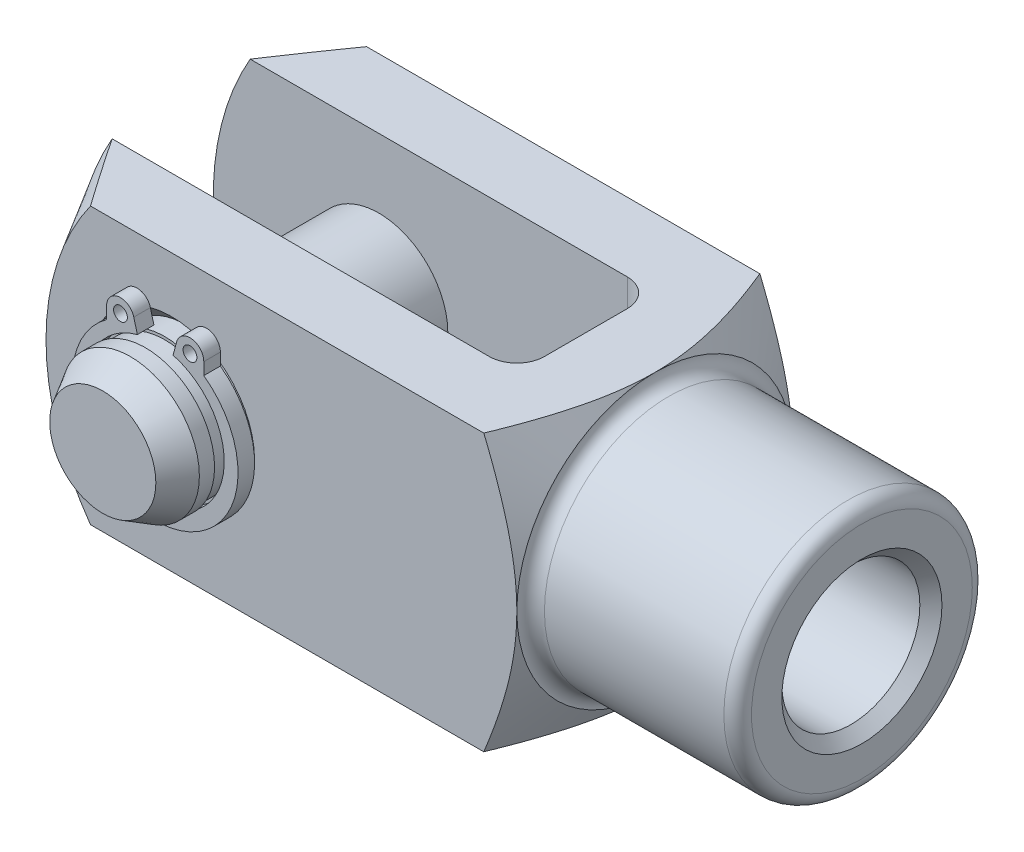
ISO-10303-21;
HEADER;
FILE_DESCRIPTION(('STEP AP214'),'2;1');
FILE_NAME('part.step','',(''),(''),'','','');
FILE_SCHEMA(('AUTOMOTIVE_DESIGN { 1 0 10303 214 1 1 1 1 }'));
ENDSEC;
DATA;
#1=APPLICATION_CONTEXT('core data for automotive mechanical design processes');
#2=APPLICATION_PROTOCOL_DEFINITION('international standard','automotive_design',2000,#1);
#3=PRODUCT_CONTEXT('',#1,'mechanical');
#4=PRODUCT('Part','Part','',(#3));
#5=PRODUCT_RELATED_PRODUCT_CATEGORY('part','',(#4));
#6=PRODUCT_DEFINITION_FORMATION('','',#4);
#7=PRODUCT_DEFINITION_CONTEXT('part definition',#1,'design');
#8=PRODUCT_DEFINITION('design','',#6,#7);
#9=PRODUCT_DEFINITION_SHAPE('','',#8);
#10=(LENGTH_UNIT() NAMED_UNIT(*) SI_UNIT(.MILLI.,.METRE.));
#11=(NAMED_UNIT(*) PLANE_ANGLE_UNIT() SI_UNIT($,.RADIAN.));
#12=(NAMED_UNIT(*) SI_UNIT($,.STERADIAN.) SOLID_ANGLE_UNIT());
#13=UNCERTAINTY_MEASURE_WITH_UNIT(LENGTH_MEASURE(1.E-05),#10,'distance_accuracy_value','');
#14=(GEOMETRIC_REPRESENTATION_CONTEXT(3) GLOBAL_UNCERTAINTY_ASSIGNED_CONTEXT((#13)) GLOBAL_UNIT_ASSIGNED_CONTEXT((#10,
#11,#12)) REPRESENTATION_CONTEXT('',''));
#15=CARTESIAN_POINT('',(0.,0.,0.));
#16=DIRECTION('',(0.,0.,1.));
#17=DIRECTION('',(1.,0.,0.));
#18=AXIS2_PLACEMENT_3D('',#15,#16,#17);
#19=CARTESIAN_POINT('',(-20.,0.,7.5));
#20=DIRECTION('',(0.,0.,-1.));
#21=DIRECTION('',(-1.,0.,0.));
#22=AXIS2_PLACEMENT_3D('',#19,#20,#21);
#23=CYLINDRICAL_SURFACE('',#22,2.5);
#24=CARTESIAN_POINT('',(-20.,0.,5.25));
#25=DIRECTION('',(0.,0.,1.));
#26=DIRECTION('',(1.,0.,0.));
#27=AXIS2_PLACEMENT_3D('',#24,#25,#26);
#28=CIRCLE('',#27,2.5);
#29=CARTESIAN_POINT('',(-17.5,0.,5.25));
#30=VERTEX_POINT('',#29);
#31=EDGE_CURVE('P0_E55',#30,#30,#28,.T.);
#32=ORIENTED_EDGE('',*,*,#31,.F.);
#33=EDGE_LOOP('',(#32));
#34=FACE_BOUND('',#33,.T.);
#35=CARTESIAN_POINT('',(-20.,0.,-5.25));
#36=DIRECTION('',(0.,0.,1.));
#37=DIRECTION('',(1.,0.,0.));
#38=AXIS2_PLACEMENT_3D('',#35,#36,#37);
#39=CIRCLE('',#38,2.5);
#40=CARTESIAN_POINT('',(-17.5,0.,-5.25));
#41=VERTEX_POINT('',#40);
#42=EDGE_CURVE('P0_E40',#41,#41,#39,.T.);
#43=ORIENTED_EDGE('',*,*,#42,.T.);
#44=EDGE_LOOP('',(#43));
#45=FACE_BOUND('',#44,.T.);
#46=ADVANCED_FACE('P0_F14',(#34,#45),#23,.T.);
#47=CARTESIAN_POINT('',(-20.,0.,-5.95));
#48=DIRECTION('',(0.,0.,1.));
#49=DIRECTION('',(1.,0.,0.));
#50=AXIS2_PLACEMENT_3D('',#47,#48,#49);
#51=CIRCLE('',#50,2.5);
#52=CARTESIAN_POINT('',(-17.5,0.,-5.95));
#53=VERTEX_POINT('',#52);
#54=EDGE_CURVE('P0_E43',#53,#53,#51,.T.);
#55=ORIENTED_EDGE('',*,*,#54,.F.);
#56=EDGE_LOOP('',(#55));
#57=FACE_BOUND('',#56,.T.);
#58=CARTESIAN_POINT('',(-20.,0.,-6.5));
#59=DIRECTION('',(0.,0.,1.));
#60=DIRECTION('',(1.,0.,0.));
#61=AXIS2_PLACEMENT_3D('',#58,#59,#60);
#62=CIRCLE('',#61,2.5);
#63=CARTESIAN_POINT('',(-17.5,0.,-6.5));
#64=VERTEX_POINT('',#63);
#65=EDGE_CURVE('P0_E25',#64,#64,#62,.T.);
#66=ORIENTED_EDGE('',*,*,#65,.T.);
#67=EDGE_LOOP('',(#66));
#68=FACE_BOUND('',#67,.T.);
#69=ADVANCED_FACE('P0_F63',(#57,#68),#23,.T.);
#70=CARTESIAN_POINT('',(-20.,0.,-7.5));
#71=DIRECTION('',(0.,0.,1.));
#72=DIRECTION('',(1.,0.,0.));
#73=AXIS2_PLACEMENT_3D('',#70,#71,#72);
#74=PLANE('',#73);
#75=CARTESIAN_POINT('',(-20.,0.,-7.5));
#76=DIRECTION('',(0.,0.,1.));
#77=DIRECTION('',(1.,0.,0.));
#78=AXIS2_PLACEMENT_3D('',#75,#76,#77);
#79=CIRCLE('',#78,1.92264973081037);
#80=CARTESIAN_POINT('',(-18.0773502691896,0.,-7.5));
#81=VERTEX_POINT('',#80);
#82=EDGE_CURVE('P0_E21',#81,#81,#79,.F.);
#83=ORIENTED_EDGE('',*,*,#82,.T.);
#84=EDGE_LOOP('',(#83));
#85=FACE_BOUND('',#84,.T.);
#86=ADVANCED_FACE('P0_F89',(#85),#74,.F.);
#87=CARTESIAN_POINT('',(-20.,0.,-6.5));
#88=DIRECTION('',(0.,0.,1.));
#89=DIRECTION('',(1.,0.,0.));
#90=AXIS2_PLACEMENT_3D('',#87,#88,#89);
#91=CONICAL_SURFACE('',#90,2.5,0.523598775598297);
#92=ORIENTED_EDGE('',*,*,#82,.F.);
#93=EDGE_LOOP('',(#92));
#94=FACE_BOUND('',#93,.T.);
#95=ORIENTED_EDGE('',*,*,#65,.F.);
#96=EDGE_LOOP('',(#95));
#97=FACE_BOUND('',#96,.T.);
#98=ADVANCED_FACE('P0_F83',(#94,#97),#91,.T.);
#99=CARTESIAN_POINT('',(-20.,2.5,-5.95));
#100=DIRECTION('',(0.,0.,-1.));
#101=DIRECTION('',(-1.,0.,0.));
#102=AXIS2_PLACEMENT_3D('',#99,#100,#101);
#103=PLANE('',#102);
#104=CARTESIAN_POINT('',(-20.,0.,-5.95));
#105=DIRECTION('',(0.,0.,1.));
#106=DIRECTION('',(1.,0.,0.));
#107=AXIS2_PLACEMENT_3D('',#104,#105,#106);
#108=CIRCLE('',#107,2.4);
#109=CARTESIAN_POINT('',(-17.6,0.,-5.95));
#110=VERTEX_POINT('',#109);
#111=EDGE_CURVE('P0_E34',#110,#110,#108,.T.);
#112=ORIENTED_EDGE('',*,*,#111,.F.);
#113=EDGE_LOOP('',(#112));
#114=FACE_BOUND('',#113,.T.);
#115=ORIENTED_EDGE('',*,*,#54,.T.);
#116=EDGE_LOOP('',(#115));
#117=FACE_BOUND('',#116,.T.);
#118=ADVANCED_FACE('P0_F77',(#114,#117),#103,.F.);
#119=CARTESIAN_POINT('',(-20.,0.,6.5));
#120=DIRECTION('',(0.,0.,1.));
#121=DIRECTION('',(1.,0.,0.));
#122=AXIS2_PLACEMENT_3D('',#119,#120,#121);
#123=CYLINDRICAL_SURFACE('',#122,2.4);
#124=CARTESIAN_POINT('',(-20.,0.,-5.25));
#125=DIRECTION('',(0.,0.,1.));
#126=DIRECTION('',(1.,0.,0.));
#127=AXIS2_PLACEMENT_3D('',#124,#125,#126);
#128=CIRCLE('',#127,2.4);
#129=CARTESIAN_POINT('',(-17.6,0.,-5.25));
#130=VERTEX_POINT('',#129);
#131=EDGE_CURVE('P0_E37',#130,#130,#128,.T.);
#132=ORIENTED_EDGE('',*,*,#131,.F.);
#133=EDGE_LOOP('',(#132));
#134=FACE_BOUND('',#133,.T.);
#135=ORIENTED_EDGE('',*,*,#111,.T.);
#136=EDGE_LOOP('',(#135));
#137=FACE_BOUND('',#136,.T.);
#138=ADVANCED_FACE('P0_F71',(#134,#137),#123,.T.);
#139=CARTESIAN_POINT('',(-20.,2.5,-5.25));
#140=DIRECTION('',(0.,0.,1.));
#141=DIRECTION('',(1.,0.,0.));
#142=AXIS2_PLACEMENT_3D('',#139,#140,#141);
#143=PLANE('',#142);
#144=ORIENTED_EDGE('',*,*,#42,.F.);
#145=EDGE_LOOP('',(#144));
#146=FACE_BOUND('',#145,.T.);
#147=ORIENTED_EDGE('',*,*,#131,.T.);
#148=EDGE_LOOP('',(#147));
#149=FACE_BOUND('',#148,.T.);
#150=ADVANCED_FACE('P0_F68',(#146,#149),#143,.F.);
#151=CARTESIAN_POINT('',(-20.,2.5,5.25));
#152=DIRECTION('',(0.,0.,-1.));
#153=DIRECTION('',(-1.,0.,0.));
#154=AXIS2_PLACEMENT_3D('',#151,#152,#153);
#155=PLANE('',#154);
#156=CARTESIAN_POINT('',(-20.,0.,5.25));
#157=DIRECTION('',(0.,0.,1.));
#158=DIRECTION('',(1.,0.,0.));
#159=AXIS2_PLACEMENT_3D('',#156,#157,#158);
#160=CIRCLE('',#159,2.4);
#161=CARTESIAN_POINT('',(-17.6,0.,5.25));
#162=VERTEX_POINT('',#161);
#163=EDGE_CURVE('P0_E46',#162,#162,#160,.T.);
#164=ORIENTED_EDGE('',*,*,#163,.F.);
#165=EDGE_LOOP('',(#164));
#166=FACE_BOUND('',#165,.T.);
#167=ORIENTED_EDGE('',*,*,#31,.T.);
#168=EDGE_LOOP('',(#167));
#169=FACE_BOUND('',#168,.T.);
#170=ADVANCED_FACE('P0_F59',(#166,#169),#155,.F.);
#171=CARTESIAN_POINT('',(-20.,0.,6.5));
#172=DIRECTION('',(0.,0.,1.));
#173=DIRECTION('',(1.,0.,0.));
#174=AXIS2_PLACEMENT_3D('',#171,#172,#173);
#175=CYLINDRICAL_SURFACE('',#174,2.4);
#176=CARTESIAN_POINT('',(-20.,0.,5.95));
#177=DIRECTION('',(0.,0.,1.));
#178=DIRECTION('',(1.,0.,0.));
#179=AXIS2_PLACEMENT_3D('',#176,#177,#178);
#180=CIRCLE('',#179,2.4);
#181=CARTESIAN_POINT('',(-17.6,0.,5.95));
#182=VERTEX_POINT('',#181);
#183=EDGE_CURVE('P0_E49',#182,#182,#180,.T.);
#184=ORIENTED_EDGE('',*,*,#183,.F.);
#185=EDGE_LOOP('',(#184));
#186=FACE_BOUND('',#185,.T.);
#187=ORIENTED_EDGE('',*,*,#163,.T.);
#188=EDGE_LOOP('',(#187));
#189=FACE_BOUND('',#188,.T.);
#190=ADVANCED_FACE('P0_F108',(#186,#189),#175,.T.);
#191=CARTESIAN_POINT('',(-20.,2.5,5.95));
#192=DIRECTION('',(0.,0.,1.));
#193=DIRECTION('',(1.,0.,0.));
#194=AXIS2_PLACEMENT_3D('',#191,#192,#193);
#195=PLANE('',#194);
#196=CARTESIAN_POINT('',(-20.,0.,5.95));
#197=DIRECTION('',(0.,0.,1.));
#198=DIRECTION('',(1.,0.,0.));
#199=AXIS2_PLACEMENT_3D('',#196,#197,#198);
#200=CIRCLE('',#199,2.5);
#201=CARTESIAN_POINT('',(-17.5,0.,5.95));
#202=VERTEX_POINT('',#201);
#203=EDGE_CURVE('P0_E52',#202,#202,#200,.T.);
#204=ORIENTED_EDGE('',*,*,#203,.F.);
#205=EDGE_LOOP('',(#204));
#206=FACE_BOUND('',#205,.T.);
#207=ORIENTED_EDGE('',*,*,#183,.T.);
#208=EDGE_LOOP('',(#207));
#209=FACE_BOUND('',#208,.T.);
#210=ADVANCED_FACE('P0_F104',(#206,#209),#195,.F.);
#211=CARTESIAN_POINT('',(-20.,0.,7.5));
#212=DIRECTION('',(0.,0.,1.));
#213=DIRECTION('',(1.,0.,0.));
#214=AXIS2_PLACEMENT_3D('',#211,#212,#213);
#215=PLANE('',#214);
#216=CARTESIAN_POINT('',(-20.,0.,7.5));
#217=DIRECTION('',(0.,0.,1.));
#218=DIRECTION('',(1.,0.,0.));
#219=AXIS2_PLACEMENT_3D('',#216,#217,#218);
#220=CIRCLE('',#219,1.92264973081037);
#221=CARTESIAN_POINT('',(-18.0773502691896,0.,7.5));
#222=VERTEX_POINT('',#221);
#223=EDGE_CURVE('P0_E10',#222,#222,#220,.T.);
#224=ORIENTED_EDGE('',*,*,#223,.T.);
#225=EDGE_LOOP('',(#224));
#226=FACE_BOUND('',#225,.T.);
#227=ADVANCED_FACE('P0_F102',(#226),#215,.T.);
#228=CARTESIAN_POINT('',(-20.,0.,7.5));
#229=DIRECTION('',(0.,0.,-1.));
#230=DIRECTION('',(-1.,0.,0.));
#231=AXIS2_PLACEMENT_3D('',#228,#229,#230);
#232=CONICAL_SURFACE('',#231,1.92264973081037,0.523598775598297);
#233=CARTESIAN_POINT('',(-20.,0.,6.5));
#234=DIRECTION('',(0.,0.,1.));
#235=DIRECTION('',(1.,0.,0.));
#236=AXIS2_PLACEMENT_3D('',#233,#234,#235);
#237=CIRCLE('',#236,2.5);
#238=CARTESIAN_POINT('',(-17.5,0.,6.5));
#239=VERTEX_POINT('',#238);
#240=EDGE_CURVE('P0_E29',#239,#239,#237,.F.);
#241=ORIENTED_EDGE('',*,*,#240,.F.);
#242=EDGE_LOOP('',(#241));
#243=FACE_BOUND('',#242,.T.);
#244=ORIENTED_EDGE('',*,*,#223,.F.);
#245=EDGE_LOOP('',(#244));
#246=FACE_BOUND('',#245,.T.);
#247=ADVANCED_FACE('P0_F16',(#243,#246),#232,.T.);
#248=ORIENTED_EDGE('',*,*,#203,.T.);
#249=EDGE_LOOP('',(#248));
#250=FACE_BOUND('',#249,.T.);
#251=ORIENTED_EDGE('',*,*,#240,.T.);
#252=EDGE_LOOP('',(#251));
#253=FACE_BOUND('',#252,.T.);
#254=ADVANCED_FACE('P0_F65',(#250,#253),#23,.T.);
#255=CLOSED_SHELL('',(#46,#69,#86,#98,#118,#138,#150,#170,#190,#210,#227,#247,#254));
#256=MANIFOLD_SOLID_BREP('P0_B1',#255);
#257=CARTESIAN_POINT('',(-20.0000000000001,0.,5.59999999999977));
#258=DIRECTION('',(0.,0.,1.));
#259=DIRECTION('',(1.,0.,0.));
#260=AXIS2_PLACEMENT_3D('',#257,#258,#259);
#261=PLANE('',#260);
#262=CARTESIAN_POINT('',(-21.2594200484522,2.76836795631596,5.59999999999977));
#263=DIRECTION('',(0.,0.,1.));
#264=DIRECTION('',(1.,0.,0.));
#265=AXIS2_PLACEMENT_3D('',#262,#263,#264);
#266=CIRCLE('',#265,0.25);
#267=CARTESIAN_POINT('',(-21.0094200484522,2.76836795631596,5.59999999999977));
#268=VERTEX_POINT('',#267);
#269=EDGE_CURVE('P1_E117',#268,#268,#266,.T.);
#270=ORIENTED_EDGE('',*,*,#269,.F.);
#271=EDGE_LOOP('',(#270));
#272=FACE_BOUND('',#271,.T.);
#273=CARTESIAN_POINT('',(-20.0000000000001,0.,5.59999999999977));
#274=DIRECTION('',(0.,0.,-1.));
#275=DIRECTION('',(1.,0.,0.));
#276=AXIS2_PLACEMENT_3D('',#273,#274,#275);
#277=CIRCLE('',#276,2.5);
#278=CARTESIAN_POINT('',(-19.3529523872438,2.41481456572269,5.59999999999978));
#279=VERTEX_POINT('',#278);
#280=CARTESIAN_POINT('',(-20.6470476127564,2.41481456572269,5.59999999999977));
#281=VERTEX_POINT('',#280);
#282=EDGE_CURVE('P1_E128',#279,#281,#277,.T.);
#283=ORIENTED_EDGE('',*,*,#282,.T.);
#284=DIRECTION('',(-0.258819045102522,0.965925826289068,0.));
#285=VECTOR('',#284,1.);
#286=CARTESIAN_POINT('',(-20.6470476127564,2.41481456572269,5.59999999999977));
#287=LINE('',#286,#285);
#288=CARTESIAN_POINT('',(-20.7764571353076,2.89777747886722,5.59999999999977));
#289=VERTEX_POINT('',#288);
#290=EDGE_CURVE('P1_E76',#281,#289,#287,.T.);
#291=ORIENTED_EDGE('',*,*,#290,.T.);
#292=CARTESIAN_POINT('',(-21.2594200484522,2.76836795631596,5.59999999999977));
#293=DIRECTION('',(0.,0.,1.));
#294=DIRECTION('',(1.,0.,0.));
#295=AXIS2_PLACEMENT_3D('',#292,#293,#294);
#296=CIRCLE('',#295,0.499999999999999);
#297=CARTESIAN_POINT('',(-21.7594200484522,2.76836795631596,5.59999999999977));
#298=VERTEX_POINT('',#297);
#299=EDGE_CURVE('P1_E143',#289,#298,#296,.T.);
#300=ORIENTED_EDGE('',*,*,#299,.T.);
#301=DIRECTION('',(0.,-1.,0.));
#302=VECTOR('',#301,1.);
#303=CARTESIAN_POINT('',(-21.7594200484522,2.76836795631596,5.59999999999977));
#304=LINE('',#303,#302);
#305=CARTESIAN_POINT('',(-21.7594200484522,2.32990557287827,5.59999999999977));
#306=VERTEX_POINT('',#305);
#307=EDGE_CURVE('P1_E156',#298,#306,#304,.T.);
#308=ORIENTED_EDGE('',*,*,#307,.T.);
#309=CARTESIAN_POINT('',(-20.0000000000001,-0.0999999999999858,5.59999999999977));
#310=DIRECTION('',(0.,0.,1.));
#311=DIRECTION('',(1.,0.,0.));
#312=AXIS2_PLACEMENT_3D('',#309,#310,#311);
#313=CIRCLE('',#312,3.);
#314=CARTESIAN_POINT('',(-18.240579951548,2.32990557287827,5.59999999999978));
#315=VERTEX_POINT('',#314);
#316=EDGE_CURVE('P1_E95',#306,#315,#313,.T.);
#317=ORIENTED_EDGE('',*,*,#316,.T.);
#318=DIRECTION('',(0.,1.,0.));
#319=VECTOR('',#318,1.);
#320=CARTESIAN_POINT('',(-18.240579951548,2.76836795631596,5.59999999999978));
#321=LINE('',#320,#319);
#322=CARTESIAN_POINT('',(-18.240579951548,2.76836795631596,5.59999999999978));
#323=VERTEX_POINT('',#322);
#324=EDGE_CURVE('P1_E89',#315,#323,#321,.T.);
#325=ORIENTED_EDGE('',*,*,#324,.T.);
#326=CARTESIAN_POINT('',(-18.740579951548,2.76836795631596,5.59999999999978));
#327=DIRECTION('',(0.,0.,1.));
#328=DIRECTION('',(-1.,0.,0.));
#329=AXIS2_PLACEMENT_3D('',#326,#327,#328);
#330=CIRCLE('',#329,0.499999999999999);
#331=CARTESIAN_POINT('',(-19.2235428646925,2.89777747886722,5.59999999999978));
#332=VERTEX_POINT('',#331);
#333=EDGE_CURVE('P1_E93',#323,#332,#330,.T.);
#334=ORIENTED_EDGE('',*,*,#333,.T.);
#335=DIRECTION('',(-0.258819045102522,-0.965925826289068,0.));
#336=VECTOR('',#335,1.);
#337=CARTESIAN_POINT('',(-19.3529523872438,2.41481456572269,5.59999999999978));
#338=LINE('',#337,#336);
#339=EDGE_CURVE('P1_E33',#332,#279,#338,.T.);
#340=ORIENTED_EDGE('',*,*,#339,.T.);
#341=EDGE_LOOP('',(#283,#291,#300,#308,#317,#325,#334,#340));
#342=FACE_BOUND('',#341,.T.);
#343=CARTESIAN_POINT('',(-18.740579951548,2.76836795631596,5.59999999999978));
#344=DIRECTION('',(0.,0.,1.));
#345=DIRECTION('',(-1.,0.,0.));
#346=AXIS2_PLACEMENT_3D('',#343,#344,#345);
#347=CIRCLE('',#346,0.25);
#348=CARTESIAN_POINT('',(-18.990579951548,2.76836795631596,5.59999999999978));
#349=VERTEX_POINT('',#348);
#350=EDGE_CURVE('P1_E165',#349,#349,#347,.T.);
#351=ORIENTED_EDGE('',*,*,#350,.F.);
#352=EDGE_LOOP('',(#351));
#353=FACE_BOUND('',#352,.T.);
#354=ADVANCED_FACE('P1_F16',(#272,#342,#353),#261,.T.);
#355=CARTESIAN_POINT('',(-20.0000000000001,0.,4.99999999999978));
#356=DIRECTION('',(0.,0.,1.));
#357=DIRECTION('',(1.,0.,0.));
#358=AXIS2_PLACEMENT_3D('',#355,#356,#357);
#359=PLANE('',#358);
#360=CARTESIAN_POINT('',(-21.2594200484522,2.76836795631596,4.99999999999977));
#361=DIRECTION('',(0.,0.,1.));
#362=DIRECTION('',(1.,0.,0.));
#363=AXIS2_PLACEMENT_3D('',#360,#361,#362);
#364=CIRCLE('',#363,0.25);
#365=CARTESIAN_POINT('',(-21.0094200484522,2.76836795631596,4.99999999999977));
#366=VERTEX_POINT('',#365);
#367=EDGE_CURVE('P1_E162',#366,#366,#364,.T.);
#368=ORIENTED_EDGE('',*,*,#367,.T.);
#369=EDGE_LOOP('',(#368));
#370=FACE_BOUND('',#369,.T.);
#371=CARTESIAN_POINT('',(-20.0000000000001,0.,4.99999999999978));
#372=DIRECTION('',(0.,0.,-1.));
#373=DIRECTION('',(1.,0.,0.));
#374=AXIS2_PLACEMENT_3D('',#371,#372,#373);
#375=CIRCLE('',#374,2.5);
#376=CARTESIAN_POINT('',(-19.3529523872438,2.41481456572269,4.99999999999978));
#377=VERTEX_POINT('',#376);
#378=CARTESIAN_POINT('',(-20.6470476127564,2.41481456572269,4.99999999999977));
#379=VERTEX_POINT('',#378);
#380=EDGE_CURVE('P1_E113',#377,#379,#375,.T.);
#381=ORIENTED_EDGE('',*,*,#380,.F.);
#382=DIRECTION('',(-0.258819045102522,-0.965925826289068,0.));
#383=VECTOR('',#382,1.);
#384=CARTESIAN_POINT('',(-19.3529523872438,2.41481456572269,4.99999999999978));
#385=LINE('',#384,#383);
#386=CARTESIAN_POINT('',(-19.2235428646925,2.89777747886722,4.99999999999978));
#387=VERTEX_POINT('',#386);
#388=EDGE_CURVE('P1_E68',#387,#377,#385,.T.);
#389=ORIENTED_EDGE('',*,*,#388,.F.);
#390=CARTESIAN_POINT('',(-18.740579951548,2.76836795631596,4.99999999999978));
#391=DIRECTION('',(0.,0.,1.));
#392=DIRECTION('',(-1.,0.,0.));
#393=AXIS2_PLACEMENT_3D('',#390,#391,#392);
#394=CIRCLE('',#393,0.499999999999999);
#395=CARTESIAN_POINT('',(-18.240579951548,2.76836795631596,4.99999999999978));
#396=VERTEX_POINT('',#395);
#397=EDGE_CURVE('P1_E62',#396,#387,#394,.T.);
#398=ORIENTED_EDGE('',*,*,#397,.F.);
#399=DIRECTION('',(0.,1.,0.));
#400=VECTOR('',#399,1.);
#401=CARTESIAN_POINT('',(-18.240579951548,2.76836795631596,4.99999999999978));
#402=LINE('',#401,#400);
#403=CARTESIAN_POINT('',(-18.240579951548,2.32990557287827,4.99999999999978));
#404=VERTEX_POINT('',#403);
#405=EDGE_CURVE('P1_E103',#404,#396,#402,.T.);
#406=ORIENTED_EDGE('',*,*,#405,.F.);
#407=CARTESIAN_POINT('',(-20.0000000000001,-0.0999999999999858,4.99999999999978));
#408=DIRECTION('',(0.,0.,1.));
#409=DIRECTION('',(1.,0.,0.));
#410=AXIS2_PLACEMENT_3D('',#407,#408,#409);
#411=CIRCLE('',#410,3.);
#412=CARTESIAN_POINT('',(-21.7594200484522,2.32990557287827,4.99999999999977));
#413=VERTEX_POINT('',#412);
#414=EDGE_CURVE('P1_E123',#413,#404,#411,.T.);
#415=ORIENTED_EDGE('',*,*,#414,.F.);
#416=DIRECTION('',(0.,-1.,0.));
#417=VECTOR('',#416,1.);
#418=CARTESIAN_POINT('',(-21.7594200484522,2.76836795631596,4.99999999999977));
#419=LINE('',#418,#417);
#420=CARTESIAN_POINT('',(-21.7594200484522,2.76836795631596,4.99999999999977));
#421=VERTEX_POINT('',#420);
#422=EDGE_CURVE('P1_E121',#421,#413,#419,.T.);
#423=ORIENTED_EDGE('',*,*,#422,.F.);
#424=CARTESIAN_POINT('',(-21.2594200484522,2.76836795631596,4.99999999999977));
#425=DIRECTION('',(0.,0.,1.));
#426=DIRECTION('',(1.,0.,0.));
#427=AXIS2_PLACEMENT_3D('',#424,#425,#426);
#428=CIRCLE('',#427,0.499999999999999);
#429=CARTESIAN_POINT('',(-20.7764571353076,2.89777747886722,4.99999999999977));
#430=VERTEX_POINT('',#429);
#431=EDGE_CURVE('P1_E119',#430,#421,#428,.T.);
#432=ORIENTED_EDGE('',*,*,#431,.F.);
#433=DIRECTION('',(-0.258819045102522,0.965925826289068,0.));
#434=VECTOR('',#433,1.);
#435=CARTESIAN_POINT('',(-20.6470476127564,2.41481456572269,4.99999999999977));
#436=LINE('',#435,#434);
#437=EDGE_CURVE('P1_E116',#379,#430,#436,.T.);
#438=ORIENTED_EDGE('',*,*,#437,.F.);
#439=EDGE_LOOP('',(#381,#389,#398,#406,#415,#423,#432,#438));
#440=FACE_BOUND('',#439,.T.);
#441=CARTESIAN_POINT('',(-18.740579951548,2.76836795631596,4.99999999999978));
#442=DIRECTION('',(0.,0.,1.));
#443=DIRECTION('',(-1.,0.,0.));
#444=AXIS2_PLACEMENT_3D('',#441,#442,#443);
#445=CIRCLE('',#444,0.25);
#446=CARTESIAN_POINT('',(-18.990579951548,2.76836795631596,4.99999999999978));
#447=VERTEX_POINT('',#446);
#448=EDGE_CURVE('P1_E168',#447,#447,#445,.T.);
#449=ORIENTED_EDGE('',*,*,#448,.T.);
#450=EDGE_LOOP('',(#449));
#451=FACE_BOUND('',#450,.T.);
#452=ADVANCED_FACE('P1_F147',(#370,#440,#451),#359,.F.);
#453=CARTESIAN_POINT('',(-20.0000000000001,0.,5.59999999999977));
#454=DIRECTION('',(0.,0.,-1.));
#455=DIRECTION('',(-1.,0.,0.));
#456=AXIS2_PLACEMENT_3D('',#453,#454,#455);
#457=CYLINDRICAL_SURFACE('',#456,2.5);
#458=ORIENTED_EDGE('',*,*,#380,.T.);
#459=DIRECTION('',(0.,0.,-1.));
#460=VECTOR('',#459,1.);
#461=CARTESIAN_POINT('',(-20.6470476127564,2.41481456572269,5.59999999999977));
#462=LINE('',#461,#460);
#463=EDGE_CURVE('P1_E11',#281,#379,#462,.T.);
#464=ORIENTED_EDGE('',*,*,#463,.F.);
#465=ORIENTED_EDGE('',*,*,#282,.F.);
#466=DIRECTION('',(0.,0.,-1.));
#467=VECTOR('',#466,1.);
#468=CARTESIAN_POINT('',(-19.3529523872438,2.41481456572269,5.59999999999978));
#469=LINE('',#468,#467);
#470=EDGE_CURVE('P1_E109',#279,#377,#469,.T.);
#471=ORIENTED_EDGE('',*,*,#470,.T.);
#472=EDGE_LOOP('',(#458,#464,#465,#471));
#473=FACE_BOUND('',#472,.T.);
#474=ADVANCED_FACE('P1_F18',(#473),#457,.F.);
#475=CARTESIAN_POINT('',(-20.6470476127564,2.41481456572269,5.59999999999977));
#476=DIRECTION('',(-0.965925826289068,-0.258819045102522,0.));
#477=DIRECTION('',(0.258819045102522,-0.965925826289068,0.));
#478=AXIS2_PLACEMENT_3D('',#475,#476,#477);
#479=PLANE('',#478);
#480=ORIENTED_EDGE('',*,*,#437,.T.);
#481=DIRECTION('',(0.,0.,-1.));
#482=VECTOR('',#481,1.);
#483=CARTESIAN_POINT('',(-20.7764571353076,2.89777747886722,5.59999999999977));
#484=LINE('',#483,#482);
#485=EDGE_CURVE('P1_E25',#289,#430,#484,.T.);
#486=ORIENTED_EDGE('',*,*,#485,.F.);
#487=ORIENTED_EDGE('',*,*,#290,.F.);
#488=ORIENTED_EDGE('',*,*,#463,.T.);
#489=EDGE_LOOP('',(#480,#486,#487,#488));
#490=FACE_BOUND('',#489,.T.);
#491=ADVANCED_FACE('P1_F202',(#490),#479,.F.);
#492=CARTESIAN_POINT('',(-21.2594200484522,2.76836795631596,5.59999999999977));
#493=DIRECTION('',(0.,0.,-1.));
#494=DIRECTION('',(-1.,0.,0.));
#495=AXIS2_PLACEMENT_3D('',#492,#493,#494);
#496=CYLINDRICAL_SURFACE('',#495,0.499999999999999);
#497=ORIENTED_EDGE('',*,*,#431,.T.);
#498=DIRECTION('',(0.,0.,-1.));
#499=VECTOR('',#498,1.);
#500=CARTESIAN_POINT('',(-21.7594200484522,2.76836795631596,5.59999999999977));
#501=LINE('',#500,#499);
#502=EDGE_CURVE('P1_E135',#298,#421,#501,.T.);
#503=ORIENTED_EDGE('',*,*,#502,.F.);
#504=ORIENTED_EDGE('',*,*,#299,.F.);
#505=ORIENTED_EDGE('',*,*,#485,.T.);
#506=EDGE_LOOP('',(#497,#503,#504,#505));
#507=FACE_BOUND('',#506,.T.);
#508=ADVANCED_FACE('P1_F141',(#507),#496,.T.);
#509=CARTESIAN_POINT('',(-21.7594200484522,2.76836795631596,5.59999999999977));
#510=DIRECTION('',(1.,0.,0.));
#511=DIRECTION('',(0.,0.,-1.));
#512=AXIS2_PLACEMENT_3D('',#509,#510,#511);
#513=PLANE('',#512);
#514=ORIENTED_EDGE('',*,*,#422,.T.);
#515=DIRECTION('',(0.,0.,-1.));
#516=VECTOR('',#515,1.);
#517=CARTESIAN_POINT('',(-21.7594200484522,2.32990557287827,5.59999999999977));
#518=LINE('',#517,#516);
#519=EDGE_CURVE('P1_E132',#306,#413,#518,.T.);
#520=ORIENTED_EDGE('',*,*,#519,.F.);
#521=ORIENTED_EDGE('',*,*,#307,.F.);
#522=ORIENTED_EDGE('',*,*,#502,.T.);
#523=EDGE_LOOP('',(#514,#520,#521,#522));
#524=FACE_BOUND('',#523,.T.);
#525=ADVANCED_FACE('P1_F152',(#524),#513,.F.);
#526=CARTESIAN_POINT('',(-20.0000000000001,-0.0999999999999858,5.59999999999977));
#527=DIRECTION('',(0.,0.,-1.));
#528=DIRECTION('',(-1.,0.,0.));
#529=AXIS2_PLACEMENT_3D('',#526,#527,#528);
#530=CYLINDRICAL_SURFACE('',#529,3.);
#531=ORIENTED_EDGE('',*,*,#414,.T.);
#532=DIRECTION('',(0.,0.,-1.));
#533=VECTOR('',#532,1.);
#534=CARTESIAN_POINT('',(-18.240579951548,2.32990557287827,5.59999999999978));
#535=LINE('',#534,#533);
#536=EDGE_CURVE('P1_E104',#315,#404,#535,.T.);
#537=ORIENTED_EDGE('',*,*,#536,.F.);
#538=ORIENTED_EDGE('',*,*,#316,.F.);
#539=ORIENTED_EDGE('',*,*,#519,.T.);
#540=EDGE_LOOP('',(#531,#537,#538,#539));
#541=FACE_BOUND('',#540,.T.);
#542=ADVANCED_FACE('P1_F155',(#541),#530,.T.);
#543=CARTESIAN_POINT('',(-18.240579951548,2.76836795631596,5.59999999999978));
#544=DIRECTION('',(-1.,0.,0.));
#545=DIRECTION('',(0.,0.,1.));
#546=AXIS2_PLACEMENT_3D('',#543,#544,#545);
#547=PLANE('',#546);
#548=ORIENTED_EDGE('',*,*,#405,.T.);
#549=DIRECTION('',(0.,0.,-1.));
#550=VECTOR('',#549,1.);
#551=CARTESIAN_POINT('',(-18.240579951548,2.76836795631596,5.59999999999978));
#552=LINE('',#551,#550);
#553=EDGE_CURVE('P1_E100',#323,#396,#552,.T.);
#554=ORIENTED_EDGE('',*,*,#553,.F.);
#555=ORIENTED_EDGE('',*,*,#324,.F.);
#556=ORIENTED_EDGE('',*,*,#536,.T.);
#557=EDGE_LOOP('',(#548,#554,#555,#556));
#558=FACE_BOUND('',#557,.T.);
#559=ADVANCED_FACE('P1_F101',(#558),#547,.F.);
#560=CARTESIAN_POINT('',(-18.740579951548,2.76836795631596,5.59999999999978));
#561=DIRECTION('',(0.,0.,-1.));
#562=DIRECTION('',(-1.,0.,0.));
#563=AXIS2_PLACEMENT_3D('',#560,#561,#562);
#564=CYLINDRICAL_SURFACE('',#563,0.499999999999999);
#565=ORIENTED_EDGE('',*,*,#397,.T.);
#566=DIRECTION('',(0.,0.,-1.));
#567=VECTOR('',#566,1.);
#568=CARTESIAN_POINT('',(-19.2235428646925,2.89777747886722,5.59999999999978));
#569=LINE('',#568,#567);
#570=EDGE_CURVE('P1_E105',#332,#387,#569,.T.);
#571=ORIENTED_EDGE('',*,*,#570,.F.);
#572=ORIENTED_EDGE('',*,*,#333,.F.);
#573=ORIENTED_EDGE('',*,*,#553,.T.);
#574=EDGE_LOOP('',(#565,#571,#572,#573));
#575=FACE_BOUND('',#574,.T.);
#576=ADVANCED_FACE('P1_F107',(#575),#564,.T.);
#577=CARTESIAN_POINT('',(-19.3529523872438,2.41481456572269,5.59999999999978));
#578=DIRECTION('',(0.965925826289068,-0.258819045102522,0.));
#579=DIRECTION('',(0.258819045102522,0.965925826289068,0.));
#580=AXIS2_PLACEMENT_3D('',#577,#578,#579);
#581=PLANE('',#580);
#582=ORIENTED_EDGE('',*,*,#388,.T.);
#583=ORIENTED_EDGE('',*,*,#470,.F.);
#584=ORIENTED_EDGE('',*,*,#339,.F.);
#585=ORIENTED_EDGE('',*,*,#570,.T.);
#586=EDGE_LOOP('',(#582,#583,#584,#585));
#587=FACE_BOUND('',#586,.T.);
#588=ADVANCED_FACE('P1_F190',(#587),#581,.F.);
#589=CARTESIAN_POINT('',(-21.2594200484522,2.76836795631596,5.59999999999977));
#590=DIRECTION('',(0.,0.,-1.));
#591=DIRECTION('',(-1.,0.,0.));
#592=AXIS2_PLACEMENT_3D('',#589,#590,#591);
#593=CYLINDRICAL_SURFACE('',#592,0.25);
#594=ORIENTED_EDGE('',*,*,#269,.T.);
#595=EDGE_LOOP('',(#594));
#596=FACE_BOUND('',#595,.T.);
#597=ORIENTED_EDGE('',*,*,#367,.F.);
#598=EDGE_LOOP('',(#597));
#599=FACE_BOUND('',#598,.T.);
#600=ADVANCED_FACE('P1_F187',(#596,#599),#593,.F.);
#601=CARTESIAN_POINT('',(-18.740579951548,2.76836795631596,5.59999999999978));
#602=DIRECTION('',(0.,0.,-1.));
#603=DIRECTION('',(-1.,0.,0.));
#604=AXIS2_PLACEMENT_3D('',#601,#602,#603);
#605=CYLINDRICAL_SURFACE('',#604,0.25);
#606=ORIENTED_EDGE('',*,*,#350,.T.);
#607=EDGE_LOOP('',(#606));
#608=FACE_BOUND('',#607,.T.);
#609=ORIENTED_EDGE('',*,*,#448,.F.);
#610=EDGE_LOOP('',(#609));
#611=FACE_BOUND('',#610,.T.);
#612=ADVANCED_FACE('P1_F174',(#608,#611),#605,.F.);
#613=CLOSED_SHELL('',(#354,#452,#474,#491,#508,#525,#542,#559,#576,#588,#600,#612));
#614=MANIFOLD_SOLID_BREP('P1_B1',#613);
#615=CARTESIAN_POINT('',(-20.,0.,-5.59999999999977));
#616=DIRECTION('',(0.,0.,-1.));
#617=DIRECTION('',(-1.,0.,0.));
#618=AXIS2_PLACEMENT_3D('',#615,#616,#617);
#619=PLANE('',#618);
#620=CARTESIAN_POINT('',(-18.740579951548,2.76836795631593,-5.59999999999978));
#621=DIRECTION('',(0.,0.,-1.));
#622=DIRECTION('',(-1.,0.,0.));
#623=AXIS2_PLACEMENT_3D('',#620,#621,#622);
#624=CIRCLE('',#623,0.25);
#625=CARTESIAN_POINT('',(-18.990579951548,2.76836795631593,-5.59999999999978));
#626=VERTEX_POINT('',#625);
#627=EDGE_CURVE('P2_E117',#626,#626,#624,.T.);
#628=ORIENTED_EDGE('',*,*,#627,.F.);
#629=EDGE_LOOP('',(#628));
#630=FACE_BOUND('',#629,.T.);
#631=CARTESIAN_POINT('',(-20.,0.,-5.59999999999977));
#632=DIRECTION('',(0.,0.,1.));
#633=DIRECTION('',(-1.,0.,0.));
#634=AXIS2_PLACEMENT_3D('',#631,#632,#633);
#635=CIRCLE('',#634,2.5);
#636=CARTESIAN_POINT('',(-20.6470476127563,2.41481456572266,-5.59999999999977));
#637=VERTEX_POINT('',#636);
#638=CARTESIAN_POINT('',(-19.3529523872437,2.41481456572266,-5.59999999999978));
#639=VERTEX_POINT('',#638);
#640=EDGE_CURVE('P2_E128',#637,#639,#635,.T.);
#641=ORIENTED_EDGE('',*,*,#640,.T.);
#642=DIRECTION('',(0.258819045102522,0.965925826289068,0.));
#643=VECTOR('',#642,1.);
#644=CARTESIAN_POINT('',(-19.3529523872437,2.41481456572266,-5.59999999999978));
#645=LINE('',#644,#643);
#646=CARTESIAN_POINT('',(-19.2235428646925,2.89777747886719,-5.59999999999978));
#647=VERTEX_POINT('',#646);
#648=EDGE_CURVE('P2_E76',#639,#647,#645,.T.);
#649=ORIENTED_EDGE('',*,*,#648,.T.);
#650=CARTESIAN_POINT('',(-18.740579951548,2.76836795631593,-5.59999999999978));
#651=DIRECTION('',(0.,0.,-1.));
#652=DIRECTION('',(-1.,0.,0.));
#653=AXIS2_PLACEMENT_3D('',#650,#651,#652);
#654=CIRCLE('',#653,0.499999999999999);
#655=CARTESIAN_POINT('',(-18.240579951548,2.76836795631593,-5.59999999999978));
#656=VERTEX_POINT('',#655);
#657=EDGE_CURVE('P2_E143',#647,#656,#654,.T.);
#658=ORIENTED_EDGE('',*,*,#657,.T.);
#659=DIRECTION('',(0.,-1.,0.));
#660=VECTOR('',#659,1.);
#661=CARTESIAN_POINT('',(-18.240579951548,2.76836795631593,-5.59999999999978));
#662=LINE('',#661,#660);
#663=CARTESIAN_POINT('',(-18.240579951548,2.32990557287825,-5.59999999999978));
#664=VERTEX_POINT('',#663);
#665=EDGE_CURVE('P2_E156',#656,#664,#662,.T.);
#666=ORIENTED_EDGE('',*,*,#665,.T.);
#667=CARTESIAN_POINT('',(-20.,-0.100000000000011,-5.59999999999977));
#668=DIRECTION('',(0.,0.,-1.));
#669=DIRECTION('',(-1.,0.,0.));
#670=AXIS2_PLACEMENT_3D('',#667,#668,#669);
#671=CIRCLE('',#670,3.);
#672=CARTESIAN_POINT('',(-21.7594200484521,2.32990557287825,-5.59999999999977));
#673=VERTEX_POINT('',#672);
#674=EDGE_CURVE('P2_E95',#664,#673,#671,.T.);
#675=ORIENTED_EDGE('',*,*,#674,.T.);
#676=DIRECTION('',(0.,1.,0.));
#677=VECTOR('',#676,1.);
#678=CARTESIAN_POINT('',(-21.7594200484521,2.76836795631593,-5.59999999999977));
#679=LINE('',#678,#677);
#680=CARTESIAN_POINT('',(-21.7594200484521,2.76836795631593,-5.59999999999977));
#681=VERTEX_POINT('',#680);
#682=EDGE_CURVE('P2_E89',#673,#681,#679,.T.);
#683=ORIENTED_EDGE('',*,*,#682,.T.);
#684=CARTESIAN_POINT('',(-21.2594200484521,2.76836795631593,-5.59999999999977));
#685=DIRECTION('',(0.,0.,-1.));
#686=DIRECTION('',(1.,0.,0.));
#687=AXIS2_PLACEMENT_3D('',#684,#685,#686);
#688=CIRCLE('',#687,0.499999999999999);
#689=CARTESIAN_POINT('',(-20.7764571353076,2.89777747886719,-5.59999999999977));
#690=VERTEX_POINT('',#689);
#691=EDGE_CURVE('P2_E93',#681,#690,#688,.T.);
#692=ORIENTED_EDGE('',*,*,#691,.T.);
#693=DIRECTION('',(0.258819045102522,-0.965925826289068,0.));
#694=VECTOR('',#693,1.);
#695=CARTESIAN_POINT('',(-20.6470476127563,2.41481456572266,-5.59999999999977));
#696=LINE('',#695,#694);
#697=EDGE_CURVE('P2_E33',#690,#637,#696,.T.);
#698=ORIENTED_EDGE('',*,*,#697,.T.);
#699=EDGE_LOOP('',(#641,#649,#658,#666,#675,#683,#692,#698));
#700=FACE_BOUND('',#699,.T.);
#701=CARTESIAN_POINT('',(-21.2594200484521,2.76836795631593,-5.59999999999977));
#702=DIRECTION('',(0.,0.,-1.));
#703=DIRECTION('',(1.,0.,0.));
#704=AXIS2_PLACEMENT_3D('',#701,#702,#703);
#705=CIRCLE('',#704,0.25);
#706=CARTESIAN_POINT('',(-21.0094200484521,2.76836795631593,-5.59999999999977));
#707=VERTEX_POINT('',#706);
#708=EDGE_CURVE('P2_E165',#707,#707,#705,.T.);
#709=ORIENTED_EDGE('',*,*,#708,.F.);
#710=EDGE_LOOP('',(#709));
#711=FACE_BOUND('',#710,.T.);
#712=ADVANCED_FACE('P2_F16',(#630,#700,#711),#619,.T.);
#713=CARTESIAN_POINT('',(-20.,0.,-4.99999999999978));
#714=DIRECTION('',(0.,0.,-1.));
#715=DIRECTION('',(-1.,0.,0.));
#716=AXIS2_PLACEMENT_3D('',#713,#714,#715);
#717=PLANE('',#716);
#718=CARTESIAN_POINT('',(-18.740579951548,2.76836795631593,-4.99999999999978));
#719=DIRECTION('',(0.,0.,-1.));
#720=DIRECTION('',(-1.,0.,0.));
#721=AXIS2_PLACEMENT_3D('',#718,#719,#720);
#722=CIRCLE('',#721,0.25);
#723=CARTESIAN_POINT('',(-18.990579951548,2.76836795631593,-4.99999999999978));
#724=VERTEX_POINT('',#723);
#725=EDGE_CURVE('P2_E162',#724,#724,#722,.T.);
#726=ORIENTED_EDGE('',*,*,#725,.T.);
#727=EDGE_LOOP('',(#726));
#728=FACE_BOUND('',#727,.T.);
#729=CARTESIAN_POINT('',(-20.,0.,-4.99999999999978));
#730=DIRECTION('',(0.,0.,1.));
#731=DIRECTION('',(-1.,0.,0.));
#732=AXIS2_PLACEMENT_3D('',#729,#730,#731);
#733=CIRCLE('',#732,2.5);
#734=CARTESIAN_POINT('',(-20.6470476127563,2.41481456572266,-4.99999999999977));
#735=VERTEX_POINT('',#734);
#736=CARTESIAN_POINT('',(-19.3529523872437,2.41481456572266,-4.99999999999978));
#737=VERTEX_POINT('',#736);
#738=EDGE_CURVE('P2_E113',#735,#737,#733,.T.);
#739=ORIENTED_EDGE('',*,*,#738,.F.);
#740=DIRECTION('',(0.258819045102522,-0.965925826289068,0.));
#741=VECTOR('',#740,1.);
#742=CARTESIAN_POINT('',(-20.6470476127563,2.41481456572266,-4.99999999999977));
#743=LINE('',#742,#741);
#744=CARTESIAN_POINT('',(-20.7764571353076,2.89777747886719,-4.99999999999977));
#745=VERTEX_POINT('',#744);
#746=EDGE_CURVE('P2_E68',#745,#735,#743,.T.);
#747=ORIENTED_EDGE('',*,*,#746,.F.);
#748=CARTESIAN_POINT('',(-21.2594200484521,2.76836795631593,-4.99999999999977));
#749=DIRECTION('',(0.,0.,-1.));
#750=DIRECTION('',(1.,0.,0.));
#751=AXIS2_PLACEMENT_3D('',#748,#749,#750);
#752=CIRCLE('',#751,0.499999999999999);
#753=CARTESIAN_POINT('',(-21.7594200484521,2.76836795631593,-4.99999999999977));
#754=VERTEX_POINT('',#753);
#755=EDGE_CURVE('P2_E62',#754,#745,#752,.T.);
#756=ORIENTED_EDGE('',*,*,#755,.F.);
#757=DIRECTION('',(0.,1.,0.));
#758=VECTOR('',#757,1.);
#759=CARTESIAN_POINT('',(-21.7594200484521,2.76836795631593,-4.99999999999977));
#760=LINE('',#759,#758);
#761=CARTESIAN_POINT('',(-21.7594200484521,2.32990557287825,-4.99999999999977));
#762=VERTEX_POINT('',#761);
#763=EDGE_CURVE('P2_E103',#762,#754,#760,.T.);
#764=ORIENTED_EDGE('',*,*,#763,.F.);
#765=CARTESIAN_POINT('',(-20.,-0.100000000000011,-4.99999999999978));
#766=DIRECTION('',(0.,0.,-1.));
#767=DIRECTION('',(-1.,0.,0.));
#768=AXIS2_PLACEMENT_3D('',#765,#766,#767);
#769=CIRCLE('',#768,3.);
#770=CARTESIAN_POINT('',(-18.2405799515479,2.32990557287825,-4.99999999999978));
#771=VERTEX_POINT('',#770);
#772=EDGE_CURVE('P2_E123',#771,#762,#769,.T.);
#773=ORIENTED_EDGE('',*,*,#772,.F.);
#774=DIRECTION('',(0.,-1.,0.));
#775=VECTOR('',#774,1.);
#776=CARTESIAN_POINT('',(-18.2405799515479,2.76836795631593,-4.99999999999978));
#777=LINE('',#776,#775);
#778=CARTESIAN_POINT('',(-18.2405799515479,2.76836795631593,-4.99999999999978));
#779=VERTEX_POINT('',#778);
#780=EDGE_CURVE('P2_E121',#779,#771,#777,.T.);
#781=ORIENTED_EDGE('',*,*,#780,.F.);
#782=CARTESIAN_POINT('',(-18.740579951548,2.76836795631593,-4.99999999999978));
#783=DIRECTION('',(0.,0.,-1.));
#784=DIRECTION('',(-1.,0.,0.));
#785=AXIS2_PLACEMENT_3D('',#782,#783,#784);
#786=CIRCLE('',#785,0.499999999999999);
#787=CARTESIAN_POINT('',(-19.2235428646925,2.89777747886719,-4.99999999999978));
#788=VERTEX_POINT('',#787);
#789=EDGE_CURVE('P2_E119',#788,#779,#786,.T.);
#790=ORIENTED_EDGE('',*,*,#789,.F.);
#791=DIRECTION('',(0.258819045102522,0.965925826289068,0.));
#792=VECTOR('',#791,1.);
#793=CARTESIAN_POINT('',(-19.3529523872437,2.41481456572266,-4.99999999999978));
#794=LINE('',#793,#792);
#795=EDGE_CURVE('P2_E116',#737,#788,#794,.T.);
#796=ORIENTED_EDGE('',*,*,#795,.F.);
#797=EDGE_LOOP('',(#739,#747,#756,#764,#773,#781,#790,#796));
#798=FACE_BOUND('',#797,.T.);
#799=CARTESIAN_POINT('',(-21.2594200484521,2.76836795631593,-4.99999999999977));
#800=DIRECTION('',(0.,0.,-1.));
#801=DIRECTION('',(1.,0.,0.));
#802=AXIS2_PLACEMENT_3D('',#799,#800,#801);
#803=CIRCLE('',#802,0.25);
#804=CARTESIAN_POINT('',(-21.0094200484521,2.76836795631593,-4.99999999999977));
#805=VERTEX_POINT('',#804);
#806=EDGE_CURVE('P2_E168',#805,#805,#803,.T.);
#807=ORIENTED_EDGE('',*,*,#806,.T.);
#808=EDGE_LOOP('',(#807));
#809=FACE_BOUND('',#808,.T.);
#810=ADVANCED_FACE('P2_F147',(#728,#798,#809),#717,.F.);
#811=CARTESIAN_POINT('',(-20.,0.,-5.59999999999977));
#812=DIRECTION('',(0.,0.,1.));
#813=DIRECTION('',(1.,0.,0.));
#814=AXIS2_PLACEMENT_3D('',#811,#812,#813);
#815=CYLINDRICAL_SURFACE('',#814,2.5);
#816=ORIENTED_EDGE('',*,*,#738,.T.);
#817=DIRECTION('',(0.,0.,1.));
#818=VECTOR('',#817,1.);
#819=CARTESIAN_POINT('',(-19.3529523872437,2.41481456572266,-5.59999999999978));
#820=LINE('',#819,#818);
#821=EDGE_CURVE('P2_E11',#639,#737,#820,.T.);
#822=ORIENTED_EDGE('',*,*,#821,.F.);
#823=ORIENTED_EDGE('',*,*,#640,.F.);
#824=DIRECTION('',(0.,0.,1.));
#825=VECTOR('',#824,1.);
#826=CARTESIAN_POINT('',(-20.6470476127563,2.41481456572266,-5.59999999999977));
#827=LINE('',#826,#825);
#828=EDGE_CURVE('P2_E109',#637,#735,#827,.T.);
#829=ORIENTED_EDGE('',*,*,#828,.T.);
#830=EDGE_LOOP('',(#816,#822,#823,#829));
#831=FACE_BOUND('',#830,.T.);
#832=ADVANCED_FACE('P2_F18',(#831),#815,.F.);
#833=CARTESIAN_POINT('',(-19.3529523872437,2.41481456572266,-5.59999999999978));
#834=DIRECTION('',(0.965925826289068,-0.258819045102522,0.));
#835=DIRECTION('',(-0.258819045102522,-0.965925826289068,0.));
#836=AXIS2_PLACEMENT_3D('',#833,#834,#835);
#837=PLANE('',#836);
#838=ORIENTED_EDGE('',*,*,#795,.T.);
#839=DIRECTION('',(0.,0.,1.));
#840=VECTOR('',#839,1.);
#841=CARTESIAN_POINT('',(-19.2235428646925,2.89777747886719,-5.59999999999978));
#842=LINE('',#841,#840);
#843=EDGE_CURVE('P2_E25',#647,#788,#842,.T.);
#844=ORIENTED_EDGE('',*,*,#843,.F.);
#845=ORIENTED_EDGE('',*,*,#648,.F.);
#846=ORIENTED_EDGE('',*,*,#821,.T.);
#847=EDGE_LOOP('',(#838,#844,#845,#846));
#848=FACE_BOUND('',#847,.T.);
#849=ADVANCED_FACE('P2_F202',(#848),#837,.F.);
#850=CARTESIAN_POINT('',(-18.740579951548,2.76836795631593,-5.59999999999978));
#851=DIRECTION('',(0.,0.,1.));
#852=DIRECTION('',(1.,0.,0.));
#853=AXIS2_PLACEMENT_3D('',#850,#851,#852);
#854=CYLINDRICAL_SURFACE('',#853,0.499999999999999);
#855=ORIENTED_EDGE('',*,*,#789,.T.);
#856=DIRECTION('',(0.,0.,1.));
#857=VECTOR('',#856,1.);
#858=CARTESIAN_POINT('',(-18.240579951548,2.76836795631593,-5.59999999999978));
#859=LINE('',#858,#857);
#860=EDGE_CURVE('P2_E135',#656,#779,#859,.T.);
#861=ORIENTED_EDGE('',*,*,#860,.F.);
#862=ORIENTED_EDGE('',*,*,#657,.F.);
#863=ORIENTED_EDGE('',*,*,#843,.T.);
#864=EDGE_LOOP('',(#855,#861,#862,#863));
#865=FACE_BOUND('',#864,.T.);
#866=ADVANCED_FACE('P2_F141',(#865),#854,.T.);
#867=CARTESIAN_POINT('',(-18.240579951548,2.76836795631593,-5.59999999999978));
#868=DIRECTION('',(-1.,0.,0.));
#869=DIRECTION('',(0.,0.,1.));
#870=AXIS2_PLACEMENT_3D('',#867,#868,#869);
#871=PLANE('',#870);
#872=ORIENTED_EDGE('',*,*,#780,.T.);
#873=DIRECTION('',(0.,0.,1.));
#874=VECTOR('',#873,1.);
#875=CARTESIAN_POINT('',(-18.240579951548,2.32990557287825,-5.59999999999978));
#876=LINE('',#875,#874);
#877=EDGE_CURVE('P2_E132',#664,#771,#876,.T.);
#878=ORIENTED_EDGE('',*,*,#877,.F.);
#879=ORIENTED_EDGE('',*,*,#665,.F.);
#880=ORIENTED_EDGE('',*,*,#860,.T.);
#881=EDGE_LOOP('',(#872,#878,#879,#880));
#882=FACE_BOUND('',#881,.T.);
#883=ADVANCED_FACE('P2_F152',(#882),#871,.F.);
#884=CARTESIAN_POINT('',(-20.,-0.100000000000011,-5.59999999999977));
#885=DIRECTION('',(0.,0.,1.));
#886=DIRECTION('',(1.,0.,0.));
#887=AXIS2_PLACEMENT_3D('',#884,#885,#886);
#888=CYLINDRICAL_SURFACE('',#887,3.);
#889=ORIENTED_EDGE('',*,*,#772,.T.);
#890=DIRECTION('',(0.,0.,1.));
#891=VECTOR('',#890,1.);
#892=CARTESIAN_POINT('',(-21.7594200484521,2.32990557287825,-5.59999999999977));
#893=LINE('',#892,#891);
#894=EDGE_CURVE('P2_E104',#673,#762,#893,.T.);
#895=ORIENTED_EDGE('',*,*,#894,.F.);
#896=ORIENTED_EDGE('',*,*,#674,.F.);
#897=ORIENTED_EDGE('',*,*,#877,.T.);
#898=EDGE_LOOP('',(#889,#895,#896,#897));
#899=FACE_BOUND('',#898,.T.);
#900=ADVANCED_FACE('P2_F155',(#899),#888,.T.);
#901=CARTESIAN_POINT('',(-21.7594200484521,2.76836795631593,-5.59999999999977));
#902=DIRECTION('',(1.,0.,0.));
#903=DIRECTION('',(0.,0.,-1.));
#904=AXIS2_PLACEMENT_3D('',#901,#902,#903);
#905=PLANE('',#904);
#906=ORIENTED_EDGE('',*,*,#763,.T.);
#907=DIRECTION('',(0.,0.,1.));
#908=VECTOR('',#907,1.);
#909=CARTESIAN_POINT('',(-21.7594200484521,2.76836795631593,-5.59999999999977));
#910=LINE('',#909,#908);
#911=EDGE_CURVE('P2_E100',#681,#754,#910,.T.);
#912=ORIENTED_EDGE('',*,*,#911,.F.);
#913=ORIENTED_EDGE('',*,*,#682,.F.);
#914=ORIENTED_EDGE('',*,*,#894,.T.);
#915=EDGE_LOOP('',(#906,#912,#913,#914));
#916=FACE_BOUND('',#915,.T.);
#917=ADVANCED_FACE('P2_F101',(#916),#905,.F.);
#918=CARTESIAN_POINT('',(-21.2594200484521,2.76836795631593,-5.59999999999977));
#919=DIRECTION('',(0.,0.,1.));
#920=DIRECTION('',(1.,0.,0.));
#921=AXIS2_PLACEMENT_3D('',#918,#919,#920);
#922=CYLINDRICAL_SURFACE('',#921,0.499999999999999);
#923=ORIENTED_EDGE('',*,*,#755,.T.);
#924=DIRECTION('',(0.,0.,1.));
#925=VECTOR('',#924,1.);
#926=CARTESIAN_POINT('',(-20.7764571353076,2.89777747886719,-5.59999999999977));
#927=LINE('',#926,#925);
#928=EDGE_CURVE('P2_E105',#690,#745,#927,.T.);
#929=ORIENTED_EDGE('',*,*,#928,.F.);
#930=ORIENTED_EDGE('',*,*,#691,.F.);
#931=ORIENTED_EDGE('',*,*,#911,.T.);
#932=EDGE_LOOP('',(#923,#929,#930,#931));
#933=FACE_BOUND('',#932,.T.);
#934=ADVANCED_FACE('P2_F107',(#933),#922,.T.);
#935=CARTESIAN_POINT('',(-20.6470476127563,2.41481456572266,-5.59999999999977));
#936=DIRECTION('',(-0.965925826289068,-0.258819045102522,0.));
#937=DIRECTION('',(-0.258819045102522,0.965925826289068,0.));
#938=AXIS2_PLACEMENT_3D('',#935,#936,#937);
#939=PLANE('',#938);
#940=ORIENTED_EDGE('',*,*,#746,.T.);
#941=ORIENTED_EDGE('',*,*,#828,.F.);
#942=ORIENTED_EDGE('',*,*,#697,.F.);
#943=ORIENTED_EDGE('',*,*,#928,.T.);
#944=EDGE_LOOP('',(#940,#941,#942,#943));
#945=FACE_BOUND('',#944,.T.);
#946=ADVANCED_FACE('P2_F190',(#945),#939,.F.);
#947=CARTESIAN_POINT('',(-18.740579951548,2.76836795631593,-5.59999999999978));
#948=DIRECTION('',(0.,0.,1.));
#949=DIRECTION('',(1.,0.,0.));
#950=AXIS2_PLACEMENT_3D('',#947,#948,#949);
#951=CYLINDRICAL_SURFACE('',#950,0.25);
#952=ORIENTED_EDGE('',*,*,#627,.T.);
#953=EDGE_LOOP('',(#952));
#954=FACE_BOUND('',#953,.T.);
#955=ORIENTED_EDGE('',*,*,#725,.F.);
#956=EDGE_LOOP('',(#955));
#957=FACE_BOUND('',#956,.T.);
#958=ADVANCED_FACE('P2_F187',(#954,#957),#951,.F.);
#959=CARTESIAN_POINT('',(-21.2594200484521,2.76836795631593,-5.59999999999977));
#960=DIRECTION('',(0.,0.,1.));
#961=DIRECTION('',(1.,0.,0.));
#962=AXIS2_PLACEMENT_3D('',#959,#960,#961);
#963=CYLINDRICAL_SURFACE('',#962,0.25);
#964=ORIENTED_EDGE('',*,*,#708,.T.);
#965=EDGE_LOOP('',(#964));
#966=FACE_BOUND('',#965,.T.);
#967=ORIENTED_EDGE('',*,*,#806,.F.);
#968=EDGE_LOOP('',(#967));
#969=FACE_BOUND('',#968,.T.);
#970=ADVANCED_FACE('P2_F174',(#966,#969),#963,.F.);
#971=CLOSED_SHELL('',(#712,#810,#832,#849,#866,#883,#900,#917,#934,#946,#958,#970));
#972=MANIFOLD_SOLID_BREP('P2_B1',#971);
#973=CARTESIAN_POINT('',(-11.,-5.,-1.49999999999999));
#974=DIRECTION('',(0.,-1.,0.));
#975=DIRECTION('',(0.,0.,-1.));
#976=AXIS2_PLACEMENT_3D('',#973,#974,#975);
#977=CYLINDRICAL_SURFACE('',#976,1.);
#978=DIRECTION('',(0.,1.,0.));
#979=VECTOR('',#978,1.);
#980=CARTESIAN_POINT('',(-10.,-5.,-1.49999999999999));
#981=LINE('',#980,#979);
#982=CARTESIAN_POINT('',(-10.,-2.00000000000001,-1.49999999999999));
#983=VERTEX_POINT('',#982);
#984=CARTESIAN_POINT('',(-10.,-5.,-1.49999999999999));
#985=VERTEX_POINT('',#984);
#986=EDGE_CURVE('P3_E306',#983,#985,#981,.F.);
#987=ORIENTED_EDGE('',*,*,#986,.F.);
#988=CARTESIAN_POINT('',(-10.,-2.00000000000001,-1.49999999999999));
#989=CARTESIAN_POINT('',(-10.0000040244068,-1.97434871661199,-1.53421120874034));
#990=CARTESIAN_POINT('',(-10.0017545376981,-1.94783623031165,-1.56772297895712));
#991=CARTESIAN_POINT('',(-10.0083551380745,-1.89333893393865,-1.63311650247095));
#992=CARTESIAN_POINT('',(-10.0131998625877,-1.86535674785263,-1.66500097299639));
#993=CARTESIAN_POINT('',(-10.0316746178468,-1.7800086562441,-1.75742787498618));
#994=CARTESIAN_POINT('',(-10.0492612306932,-1.72072597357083,-1.81542638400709));
#995=CARTESIAN_POINT('',(-10.1015919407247,-1.57251315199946,-1.9469916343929));
#996=CARTESIAN_POINT('',(-10.1404500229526,-1.4816780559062,-2.01671959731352));
#997=CARTESIAN_POINT('',(-10.2290989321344,-1.2947669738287,-2.14156776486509));
#998=CARTESIAN_POINT('',(-10.2789555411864,-1.19866218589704,-2.19659547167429));
#999=CARTESIAN_POINT('',(-10.3701258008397,-1.03200593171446,-2.27834958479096));
#1000=CARTESIAN_POINT('',(-10.4096778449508,-0.962194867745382,-2.30864712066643));
#1001=CARTESIAN_POINT('',(-10.4913965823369,-0.821458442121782,-2.36238926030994));
#1002=CARTESIAN_POINT('',(-10.5335644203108,-0.750532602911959,-2.38583083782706));
#1003=CARTESIAN_POINT('',(-10.6625948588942,-0.536940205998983,-2.44613120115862));
#1004=CARTESIAN_POINT('',(-10.7522192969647,-0.393043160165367,-2.47316437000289));
#1005=CARTESIAN_POINT('',(-10.8932818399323,-0.168755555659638,-2.49559347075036));
#1006=CARTESIAN_POINT('',(-10.9439640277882,-0.0886013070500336,-2.49971490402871));
#1007=CARTESIAN_POINT('',(-10.9964365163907,-0.00563435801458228,-2.49999523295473));
#1008=CARTESIAN_POINT('',(-10.998218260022,-0.00281717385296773,-2.49999999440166));
#1009=CARTESIAN_POINT('',(-11.,0.,-2.49999999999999));
#1010=B_SPLINE_CURVE_WITH_KNOTS('',3,(#988,#989,#990,#991,#992,#993,#994,#995,#996,#997,#998,
#999,#1000,#1001,#1002,#1003,#1004,#1005,#1006,#1007,#1008,#1009),.UNSPECIFIED.,.F.,.F.,(4,2,2,
2,2,2,2,2,2,2,4),(0.,0.128161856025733,0.256102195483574,0.509450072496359,0.870315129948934,
1.23340004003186,1.49037285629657,1.74745893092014,2.26009785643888,2.54460067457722,
2.55460068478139),.UNSPECIFIED.);
#1011=CARTESIAN_POINT('',(-11.,0.,-2.49999999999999));
#1012=VERTEX_POINT('',#1011);
#1013=EDGE_CURVE('P3_E329',#983,#1012,#1010,.T.);
#1014=ORIENTED_EDGE('',*,*,#1013,.T.);
#1015=DIRECTION('',(0.,1.,0.));
#1016=VECTOR('',#1015,1.);
#1017=CARTESIAN_POINT('',(-11.,5.,-2.49999999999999));
#1018=LINE('',#1017,#1016);
#1019=CARTESIAN_POINT('',(-11.,-5.,-2.49999999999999));
#1020=VERTEX_POINT('',#1019);
#1021=EDGE_CURVE('P3_E153',#1020,#1012,#1018,.T.);
#1022=ORIENTED_EDGE('',*,*,#1021,.F.);
#1023=CARTESIAN_POINT('',(-11.,-5.,-1.49999999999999));
#1024=DIRECTION('',(0.,-1.,0.));
#1025=DIRECTION('',(0.,0.,-1.));
#1026=AXIS2_PLACEMENT_3D('',#1023,#1024,#1025);
#1027=CIRCLE('',#1026,1.);
#1028=EDGE_CURVE('P3_E164',#985,#1020,#1027,.F.);
#1029=ORIENTED_EDGE('',*,*,#1028,.F.);
#1030=EDGE_LOOP('',(#987,#1014,#1022,#1029));
#1031=FACE_BOUND('',#1030,.T.);
#1032=ADVANCED_FACE('P3_F15',(#1031),#977,.F.);
#1033=CARTESIAN_POINT('',(-10.,-5.,-2.49999999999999));
#1034=DIRECTION('',(1.,0.,0.));
#1035=DIRECTION('',(0.,0.,-1.));
#1036=AXIS2_PLACEMENT_3D('',#1033,#1034,#1035);
#1037=PLANE('',#1036);
#1038=CARTESIAN_POINT('',(-10.,5.,-1.49999999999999));
#1039=VERTEX_POINT('',#1038);
#1040=CARTESIAN_POINT('',(-10.,2.00000000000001,-1.49999999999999));
#1041=VERTEX_POINT('',#1040);
#1042=EDGE_CURVE('P3_E317',#1039,#1041,#981,.F.);
#1043=ORIENTED_EDGE('',*,*,#1042,.T.);
#1044=CARTESIAN_POINT('',(-10.,0.,0.));
#1045=DIRECTION('',(1.,0.,0.));
#1046=DIRECTION('',(0.,0.,-1.));
#1047=AXIS2_PLACEMENT_3D('',#1044,#1045,#1046);
#1048=CIRCLE('',#1047,2.5);
#1049=CARTESIAN_POINT('',(-10.,2.00000000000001,1.49999999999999));
#1050=VERTEX_POINT('',#1049);
#1051=EDGE_CURVE('P3_E379',#1041,#1050,#1048,.T.);
#1052=ORIENTED_EDGE('',*,*,#1051,.T.);
#1053=DIRECTION('',(0.,1.,0.));
#1054=VECTOR('',#1053,1.);
#1055=CARTESIAN_POINT('',(-10.,5.,1.49999999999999));
#1056=LINE('',#1055,#1054);
#1057=CARTESIAN_POINT('',(-10.,5.,1.49999999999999));
#1058=VERTEX_POINT('',#1057);
#1059=EDGE_CURVE('P3_E136',#1050,#1058,#1056,.T.);
#1060=ORIENTED_EDGE('',*,*,#1059,.T.);
#1061=DIRECTION('',(0.,0.,-1.));
#1062=VECTOR('',#1061,1.);
#1063=CARTESIAN_POINT('',(-10.,5.,-2.49999999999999));
#1064=LINE('',#1063,#1062);
#1065=EDGE_CURVE('P3_E292',#1058,#1039,#1064,.T.);
#1066=ORIENTED_EDGE('',*,*,#1065,.T.);
#1067=EDGE_LOOP('',(#1043,#1052,#1060,#1066));
#1068=FACE_BOUND('',#1067,.T.);
#1069=ADVANCED_FACE('P3_F374',(#1068),#1037,.F.);
#1070=CARTESIAN_POINT('',(-11.,-5.,1.49999999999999));
#1071=DIRECTION('',(0.,-1.,0.));
#1072=DIRECTION('',(0.,0.,-1.));
#1073=AXIS2_PLACEMENT_3D('',#1070,#1071,#1072);
#1074=CYLINDRICAL_SURFACE('',#1073,1.);
#1075=ORIENTED_EDGE('',*,*,#1059,.F.);
#1076=CARTESIAN_POINT('',(-10.,2.00000000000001,1.49999999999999));
#1077=CARTESIAN_POINT('',(-10.0000040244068,1.97434871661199,1.53421120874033));
#1078=CARTESIAN_POINT('',(-10.0017545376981,1.94783623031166,1.56772297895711));
#1079=CARTESIAN_POINT('',(-10.0083551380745,1.89333893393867,1.63311650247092));
#1080=CARTESIAN_POINT('',(-10.0131998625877,1.86535674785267,1.66500097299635));
#1081=CARTESIAN_POINT('',(-10.0316746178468,1.78000865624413,1.75742787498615));
#1082=CARTESIAN_POINT('',(-10.0492612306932,1.72072597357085,1.81542638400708));
#1083=CARTESIAN_POINT('',(-10.1015919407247,1.57251315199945,1.94699163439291));
#1084=CARTESIAN_POINT('',(-10.1404500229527,1.48167805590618,2.01671959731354));
#1085=CARTESIAN_POINT('',(-10.2290989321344,1.29476697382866,2.14156776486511));
#1086=CARTESIAN_POINT('',(-10.2789555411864,1.198662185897,2.1965954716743));
#1087=CARTESIAN_POINT('',(-10.3701258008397,1.03200593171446,2.27834958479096));
#1088=CARTESIAN_POINT('',(-10.4096778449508,0.962194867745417,2.30864712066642));
#1089=CARTESIAN_POINT('',(-10.4913965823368,0.821458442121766,2.36238926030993));
#1090=CARTESIAN_POINT('',(-10.5335644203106,0.750532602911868,2.38583083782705));
#1091=CARTESIAN_POINT('',(-10.6625948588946,0.536940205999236,2.44613120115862));
#1092=CARTESIAN_POINT('',(-10.7522192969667,0.393043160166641,2.47316437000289));
#1093=CARTESIAN_POINT('',(-10.8932818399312,0.168755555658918,2.49559347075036));
#1094=CARTESIAN_POINT('',(-10.9439640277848,0.0886013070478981,2.4997149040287));
#1095=CARTESIAN_POINT('',(-10.9964365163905,0.00563435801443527,2.49999523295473));
#1096=CARTESIAN_POINT('',(-10.9982182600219,0.00281717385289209,2.49999999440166));
#1097=CARTESIAN_POINT('',(-11.,0.,2.5));
#1098=B_SPLINE_CURVE_WITH_KNOTS('',3,(#1076,#1077,#1078,#1079,#1080,#1081,#1082,#1083,#1084,
#1085,#1086,#1087,#1088,#1089,#1090,#1091,#1092,#1093,#1094,#1095,#1096,#1097),.UNSPECIFIED.,
.F.,.F.,(4,2,2,2,2,2,2,2,2,2,4),(0.,0.1281618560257,0.256102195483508,0.509450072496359,
0.870315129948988,1.23340004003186,1.49037285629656,1.74745893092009,2.26009785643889,
2.54460067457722,2.55460068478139),.UNSPECIFIED.);
#1099=CARTESIAN_POINT('',(-11.,0.,2.5));
#1100=VERTEX_POINT('',#1099);
#1101=EDGE_CURVE('P3_E122',#1050,#1100,#1098,.T.);
#1102=ORIENTED_EDGE('',*,*,#1101,.T.);
#1103=DIRECTION('',(0.,1.,0.));
#1104=VECTOR('',#1103,1.);
#1105=CARTESIAN_POINT('',(-11.,-5.,2.49999999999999));
#1106=LINE('',#1105,#1104);
#1107=CARTESIAN_POINT('',(-11.,5.,2.49999999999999));
#1108=VERTEX_POINT('',#1107);
#1109=EDGE_CURVE('P3_E135',#1108,#1100,#1106,.F.);
#1110=ORIENTED_EDGE('',*,*,#1109,.F.);
#1111=CARTESIAN_POINT('',(-11.,5.,1.49999999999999));
#1112=DIRECTION('',(0.,1.,0.));
#1113=DIRECTION('',(0.,0.,1.));
#1114=AXIS2_PLACEMENT_3D('',#1111,#1112,#1113);
#1115=CIRCLE('',#1114,1.);
#1116=EDGE_CURVE('P3_E159',#1058,#1108,#1115,.F.);
#1117=ORIENTED_EDGE('',*,*,#1116,.F.);
#1118=EDGE_LOOP('',(#1075,#1102,#1110,#1117));
#1119=FACE_BOUND('',#1118,.T.);
#1120=ADVANCED_FACE('P3_F132',(#1119),#1074,.F.);
#1121=CARTESIAN_POINT('',(-26.,-5.,-2.49999999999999));
#1122=DIRECTION('',(0.,0.,-1.));
#1123=DIRECTION('',(-1.,0.,0.));
#1124=AXIS2_PLACEMENT_3D('',#1121,#1122,#1123);
#1125=PLANE('',#1124);
#1126=CARTESIAN_POINT('',(-20.,0.,-2.49999999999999));
#1127=DIRECTION('',(0.,0.,-1.));
#1128=DIRECTION('',(-1.,0.,0.));
#1129=AXIS2_PLACEMENT_3D('',#1126,#1127,#1128);
#1130=CIRCLE('',#1129,2.5);
#1131=CARTESIAN_POINT('',(-22.5,0.,-2.49999999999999));
#1132=VERTEX_POINT('',#1131);
#1133=EDGE_CURVE('P3_E313',#1132,#1132,#1130,.F.);
#1134=ORIENTED_EDGE('',*,*,#1133,.F.);
#1135=EDGE_LOOP('',(#1134));
#1136=FACE_BOUND('',#1135,.T.);
#1137=CARTESIAN_POINT('',(-16.,0.,-2.49999999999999));
#1138=DIRECTION('',(0.,0.,1.));
#1139=DIRECTION('',(1.,0.,0.));
#1140=AXIS2_PLACEMENT_3D('',#1137,#1138,#1139);
#1141=CIRCLE('',#1140,10.);
#1142=CARTESIAN_POINT('',(-24.6602540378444,5.,-2.49999999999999));
#1143=VERTEX_POINT('',#1142);
#1144=CARTESIAN_POINT('',(-24.6602540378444,-5.,-2.49999999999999));
#1145=VERTEX_POINT('',#1144);
#1146=EDGE_CURVE('P3_E234',#1143,#1145,#1141,.T.);
#1147=ORIENTED_EDGE('',*,*,#1146,.T.);
#1148=DIRECTION('',(-1.,0.,0.));
#1149=VECTOR('',#1148,1.);
#1150=CARTESIAN_POINT('',(-26.,-5.,-2.49999999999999));
#1151=LINE('',#1150,#1149);
#1152=EDGE_CURVE('P3_E288',#1020,#1145,#1151,.T.);
#1153=ORIENTED_EDGE('',*,*,#1152,.F.);
#1154=ORIENTED_EDGE('',*,*,#1021,.T.);
#1155=CARTESIAN_POINT('',(-11.,5.,-2.49999999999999));
#1156=VERTEX_POINT('',#1155);
#1157=EDGE_CURVE('P3_E152',#1012,#1156,#1018,.T.);
#1158=ORIENTED_EDGE('',*,*,#1157,.T.);
#1159=DIRECTION('',(-1.,0.,0.));
#1160=VECTOR('',#1159,1.);
#1161=CARTESIAN_POINT('',(-26.,5.,-2.49999999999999));
#1162=LINE('',#1161,#1160);
#1163=EDGE_CURVE('P3_E298',#1156,#1143,#1162,.T.);
#1164=ORIENTED_EDGE('',*,*,#1163,.T.);
#1165=EDGE_LOOP('',(#1147,#1153,#1154,#1158,#1164));
#1166=FACE_BOUND('',#1165,.T.);
#1167=ADVANCED_FACE('P3_F332',(#1136,#1166),#1125,.F.);
#1168=CARTESIAN_POINT('',(-26.,-5.,2.5));
#1169=DIRECTION('',(0.,0.,1.));
#1170=DIRECTION('',(1.,0.,0.));
#1171=AXIS2_PLACEMENT_3D('',#1168,#1169,#1170);
#1172=PLANE('',#1171);
#1173=CARTESIAN_POINT('',(-20.,0.,2.5));
#1174=DIRECTION('',(0.,0.,1.));
#1175=DIRECTION('',(1.,0.,0.));
#1176=AXIS2_PLACEMENT_3D('',#1173,#1174,#1175);
#1177=CIRCLE('',#1176,2.5);
#1178=CARTESIAN_POINT('',(-17.5,0.,2.49999999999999));
#1179=VERTEX_POINT('',#1178);
#1180=EDGE_CURVE('P3_E297',#1179,#1179,#1177,.F.);
#1181=ORIENTED_EDGE('',*,*,#1180,.F.);
#1182=EDGE_LOOP('',(#1181));
#1183=FACE_BOUND('',#1182,.T.);
#1184=DIRECTION('',(1.,0.,0.));
#1185=VECTOR('',#1184,1.);
#1186=CARTESIAN_POINT('',(-26.,-5.,2.5));
#1187=LINE('',#1186,#1185);
#1188=CARTESIAN_POINT('',(-24.6602540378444,-5.,2.5));
#1189=VERTEX_POINT('',#1188);
#1190=CARTESIAN_POINT('',(-11.,-5.,2.49999999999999));
#1191=VERTEX_POINT('',#1190);
#1192=EDGE_CURVE('P3_E291',#1189,#1191,#1187,.T.);
#1193=ORIENTED_EDGE('',*,*,#1192,.F.);
#1194=CARTESIAN_POINT('',(-16.,0.,2.5));
#1195=DIRECTION('',(0.,0.,1.));
#1196=DIRECTION('',(1.,0.,0.));
#1197=AXIS2_PLACEMENT_3D('',#1194,#1195,#1196);
#1198=CIRCLE('',#1197,10.);
#1199=CARTESIAN_POINT('',(-24.6602540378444,5.,2.5));
#1200=VERTEX_POINT('',#1199);
#1201=EDGE_CURVE('P3_E370',#1200,#1189,#1198,.T.);
#1202=ORIENTED_EDGE('',*,*,#1201,.F.);
#1203=DIRECTION('',(1.,0.,0.));
#1204=VECTOR('',#1203,1.);
#1205=CARTESIAN_POINT('',(-26.,5.,2.5));
#1206=LINE('',#1205,#1204);
#1207=EDGE_CURVE('P3_E150',#1200,#1108,#1206,.T.);
#1208=ORIENTED_EDGE('',*,*,#1207,.T.);
#1209=ORIENTED_EDGE('',*,*,#1109,.T.);
#1210=EDGE_CURVE('P3_E139',#1100,#1191,#1106,.F.);
#1211=ORIENTED_EDGE('',*,*,#1210,.T.);
#1212=EDGE_LOOP('',(#1193,#1202,#1208,#1209,#1211));
#1213=FACE_BOUND('',#1212,.T.);
#1214=ADVANCED_FACE('P3_F147',(#1183,#1213),#1172,.F.);
#1215=CARTESIAN_POINT('',(-26.,-5.,5.));
#1216=DIRECTION('',(0.,0.,1.));
#1217=DIRECTION('',(1.,0.,0.));
#1218=AXIS2_PLACEMENT_3D('',#1215,#1216,#1217);
#1219=PLANE('',#1218);
#1220=CARTESIAN_POINT('',(-20.,0.,5.));
#1221=DIRECTION('',(0.,0.,1.));
#1222=DIRECTION('',(1.,0.,0.));
#1223=AXIS2_PLACEMENT_3D('',#1220,#1221,#1222);
#1224=CIRCLE('',#1223,3.);
#1225=CARTESIAN_POINT('',(-17.,0.,5.));
#1226=VERTEX_POINT('',#1225);
#1227=EDGE_CURVE('P3_E195',#1226,#1226,#1224,.F.);
#1228=ORIENTED_EDGE('',*,*,#1227,.T.);
#1229=EDGE_LOOP('',(#1228));
#1230=FACE_BOUND('',#1229,.T.);
#1231=DIRECTION('',(1.,0.,0.));
#1232=VECTOR('',#1231,1.);
#1233=CARTESIAN_POINT('',(-26.,5.,5.));
#1234=LINE('',#1233,#1232);
#1235=CARTESIAN_POINT('',(-22.9437612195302,5.,5.));
#1236=VERTEX_POINT('',#1235);
#1237=CARTESIAN_POINT('',(-8.69573155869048,5.,5.));
#1238=VERTEX_POINT('',#1237);
#1239=EDGE_CURVE('P3_E311',#1236,#1238,#1234,.T.);
#1240=ORIENTED_EDGE('',*,*,#1239,.F.);
#1241=CARTESIAN_POINT('',(-16.,0.,5.));
#1242=DIRECTION('',(0.,0.,1.));
#1243=DIRECTION('',(1.,0.,0.));
#1244=AXIS2_PLACEMENT_3D('',#1241,#1242,#1243);
#1245=CIRCLE('',#1244,8.55662432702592);
#1246=CARTESIAN_POINT('',(-22.9437612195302,-5.,5.));
#1247=VERTEX_POINT('',#1246);
#1248=EDGE_CURVE('P3_E38',#1236,#1247,#1245,.T.);
#1249=ORIENTED_EDGE('',*,*,#1248,.T.);
#1250=DIRECTION('',(1.,0.,0.));
#1251=VECTOR('',#1250,1.);
#1252=CARTESIAN_POINT('',(-26.,-5.,5.));
#1253=LINE('',#1252,#1251);
#1254=CARTESIAN_POINT('',(-8.69573155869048,-5.,5.));
#1255=VERTEX_POINT('',#1254);
#1256=EDGE_CURVE('P3_E309',#1247,#1255,#1253,.T.);
#1257=ORIENTED_EDGE('',*,*,#1256,.T.);
#1258=CARTESIAN_POINT('',(-11.1779367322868,-10.2120217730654,5.));
#1259=CARTESIAN_POINT('',(-11.0501732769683,-9.9655918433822,5.));
#1260=CARTESIAN_POINT('',(-10.9230852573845,-9.71880849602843,5.));
#1261=CARTESIAN_POINT('',(-10.6706182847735,-9.22435307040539,5.));
#1262=CARTESIAN_POINT('',(-10.5452394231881,-8.97668094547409,5.));
#1263=CARTESIAN_POINT('',(-10.2963461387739,-8.47986010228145,5.));
#1264=CARTESIAN_POINT('',(-10.1728353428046,-8.23070956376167,5.));
#1265=CARTESIAN_POINT('',(-9.92841321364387,-7.73114008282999,5.));
#1266=CARTESIAN_POINT('',(-9.80750183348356,-7.48072116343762,5.));
#1267=CARTESIAN_POINT('',(-9.56160218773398,-6.96287579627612,5.));
#1268=CARTESIAN_POINT('',(-9.43682075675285,-6.69535084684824,5.));
#1269=CARTESIAN_POINT('',(-9.19200723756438,-6.15811043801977,5.));
#1270=CARTESIAN_POINT('',(-9.07197539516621,-5.88839486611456,5.));
#1271=CARTESIAN_POINT('',(-8.8382236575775,-5.34637384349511,5.));
#1272=CARTESIAN_POINT('',(-8.72450095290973,-5.07406960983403,5.));
#1273=CARTESIAN_POINT('',(-8.50540502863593,-4.5261205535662,5.));
#1274=CARTESIAN_POINT('',(-8.40003081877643,-4.25047613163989,5.));
#1275=CARTESIAN_POINT('',(-8.23962651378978,-3.80384985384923,5.));
#1276=CARTESIAN_POINT('',(-8.18103937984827,-3.63414725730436,5.));
#1277=CARTESIAN_POINT('',(-8.06890917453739,-3.29308900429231,5.));
#1278=CARTESIAN_POINT('',(-8.01536567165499,-3.12173349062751,5.));
#1279=CARTESIAN_POINT('',(-7.91431435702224,-2.77724742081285,5.));
#1280=CARTESIAN_POINT('',(-7.86680629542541,-2.60411693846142,5.));
#1281=CARTESIAN_POINT('',(-7.77895823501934,-2.2560245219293,5.));
#1282=CARTESIAN_POINT('',(-7.73861845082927,-2.08106253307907,5.));
#1283=CARTESIAN_POINT('',(-7.66717141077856,-1.73351278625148,5.));
#1284=CARTESIAN_POINT('',(-7.63587016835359,-1.56096530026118,5.));
#1285=CARTESIAN_POINT('',(-7.58237487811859,-1.21448473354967,5.));
#1286=CARTESIAN_POINT('',(-7.56017887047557,-1.04055195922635,5.));
#1287=CARTESIAN_POINT('',(-7.52581186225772,-0.691784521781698,5.));
#1288=CARTESIAN_POINT('',(-7.5136352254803,-0.516950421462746,5.));
#1289=CARTESIAN_POINT('',(-7.49984755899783,-0.166864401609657,5.));
#1290=CARTESIAN_POINT('',(-7.49823615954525,0.008387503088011,5.));
#1291=CARTESIAN_POINT('',(-7.50538143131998,0.345895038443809,5.));
#1292=CARTESIAN_POINT('',(-7.51339117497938,0.508167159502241,5.));
#1293=CARTESIAN_POINT('',(-7.5382276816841,0.832028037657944,5.));
#1294=CARTESIAN_POINT('',(-7.55505442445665,0.993616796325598,5.));
#1295=CARTESIAN_POINT('',(-7.59690806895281,1.31580153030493,5.));
#1296=CARTESIAN_POINT('',(-7.62193920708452,1.47639694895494,5.));
#1297=CARTESIAN_POINT('',(-7.67937635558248,1.79625495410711,5.));
#1298=CARTESIAN_POINT('',(-7.71178257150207,1.95551750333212,5.));
#1299=CARTESIAN_POINT('',(-7.78410006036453,2.27716431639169,5.));
#1300=CARTESIAN_POINT('',(-7.82420141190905,2.43950551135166,5.));
#1301=CARTESIAN_POINT('',(-7.91029090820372,2.76260917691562,5.));
#1302=CARTESIAN_POINT('',(-7.95627910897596,2.9233716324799,5.));
#1303=CARTESIAN_POINT('',(-8.05325217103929,3.24336572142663,5.));
#1304=CARTESIAN_POINT('',(-8.10423680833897,3.40259742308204,5.));
#1305=CARTESIAN_POINT('',(-8.21042325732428,3.71963213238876,5.));
#1306=CARTESIAN_POINT('',(-8.26562484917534,3.87743521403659,5.));
#1307=CARTESIAN_POINT('',(-8.38422548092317,4.20455781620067,5.));
#1308=CARTESIAN_POINT('',(-8.44792594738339,4.37376771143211,5.));
#1309=CARTESIAN_POINT('',(-8.57878961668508,4.71084645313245,5.));
#1310=CARTESIAN_POINT('',(-8.64595298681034,4.8787152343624,5.));
#1311=CARTESIAN_POINT('',(-8.85177672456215,5.38062019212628,5.));
#1312=CARTESIAN_POINT('',(-8.99474620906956,5.712888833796,5.));
#1313=CARTESIAN_POINT('',(-9.28888284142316,6.37408373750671,5.));
#1314=CARTESIAN_POINT('',(-9.44005700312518,6.70300684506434,5.));
#1315=CARTESIAN_POINT('',(-9.7482557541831,7.35804934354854,5.));
#1316=CARTESIAN_POINT('',(-9.90527972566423,7.68416902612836,5.));
#1317=CARTESIAN_POINT('',(-10.2241567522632,8.33526441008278,5.));
#1318=CARTESIAN_POINT('',(-10.3860230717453,8.66023359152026,5.));
#1319=CARTESIAN_POINT('',(-10.7130699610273,9.30850558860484,5.));
#1320=CARTESIAN_POINT('',(-10.8782506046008,9.63180836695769,5.));
#1321=CARTESIAN_POINT('',(-11.2110861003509,10.2769312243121,5.));
#1322=CARTESIAN_POINT('',(-11.3787396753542,10.5987519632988,5.));
#1323=CARTESIAN_POINT('',(-11.716060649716,11.241336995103,5.));
#1324=CARTESIAN_POINT('',(-11.8857280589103,11.5621012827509,5.));
#1325=CARTESIAN_POINT('',(-12.3464966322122,12.4279667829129,5.));
#1326=CARTESIAN_POINT('',(-12.6391179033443,12.9722587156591,5.));
#1327=CARTESIAN_POINT('',(-13.2276625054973,14.0591501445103,5.));
#1328=CARTESIAN_POINT('',(-13.5235862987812,14.6017493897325,5.));
#1329=CARTESIAN_POINT('',(-14.1161130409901,15.6825374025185,5.));
#1330=CARTESIAN_POINT('',(-14.4127023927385,16.220733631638,5.));
#1331=CARTESIAN_POINT('',(-15.0076407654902,17.296041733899,5.));
#1332=CARTESIAN_POINT('',(-15.3059895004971,17.8331537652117,5.));
#1333=CARTESIAN_POINT('',(-15.6049680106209,18.3699124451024,5.));
#1334=B_SPLINE_CURVE_WITH_KNOTS('',3,(#1258,#1259,#1260,#1261,#1262,#1263,#1264,#1265,#1266,
#1267,#1268,#1269,#1270,#1271,#1272,#1273,#1274,#1275,#1276,#1277,#1278,#1279,#1280,#1281,#1282,
#1283,#1284,#1285,#1286,#1287,#1288,#1289,#1290,#1291,#1292,#1293,#1294,#1295,#1296,#1297,#1298,
#1299,#1300,#1301,#1302,#1303,#1304,#1305,#1306,#1307,#1308,#1309,#1310,#1311,#1312,#1313,#1314,
#1315,#1316,#1317,#1318,#1319,#1320,#1321,#1322,#1323,#1324,#1325,#1326,#1327,#1328,#1329,#1330,
#1331,#1332,#1333),.UNSPECIFIED.,.F.,.F.,(4,2,2,2,2,2,2,2,2,2,2,2,2,2,2,2,2,2,2,2,2,2,2,2,2,2,2,
2,2,2,2,2,2,2,2,2,2,4),(0.,0.832746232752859,1.66553684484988,2.49977764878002,3.33400336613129,
4.21955297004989,5.10514834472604,5.99034614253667,6.87543878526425,7.41396978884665,
7.95245467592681,8.49091726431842,9.02939597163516,9.55527179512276,10.0810343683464,
10.606500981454,11.1319492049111,11.6191099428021,12.1062695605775,12.5936811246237,
13.081106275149,13.5826395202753,14.0841775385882,14.5856930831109,15.0871825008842,
15.6295449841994,16.1719336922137,17.2569226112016,18.3428541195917,19.4286712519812,
20.5177991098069,21.6069512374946,22.6955592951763,23.7841726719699,25.6380502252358,
27.4921906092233,29.3357115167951,31.1789405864),.UNSPECIFIED.);
#1335=CARTESIAN_POINT('',(-7.5,0.,5.));
#1336=VERTEX_POINT('',#1335);
#1337=EDGE_CURVE('P3_E261',#1336,#1255,#1334,.F.);
#1338=ORIENTED_EDGE('',*,*,#1337,.F.);
#1339=EDGE_CURVE('P3_E259',#1238,#1336,#1334,.F.);
#1340=ORIENTED_EDGE('',*,*,#1339,.F.);
#1341=EDGE_LOOP('',(#1240,#1249,#1257,#1338,#1340));
#1342=FACE_BOUND('',#1341,.T.);
#1343=ADVANCED_FACE('P3_F245',(#1230,#1342),#1219,.T.);
#1344=CARTESIAN_POINT('',(-26.,-5.,5.));
#1345=DIRECTION('',(0.,-1.,0.));
#1346=DIRECTION('',(0.,0.,-1.));
#1347=AXIS2_PLACEMENT_3D('',#1344,#1345,#1346);
#1348=PLANE('',#1347);
#1349=ORIENTED_EDGE('',*,*,#1152,.T.);
#1350=CARTESIAN_POINT('',(-28.6161570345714,-5.,3.68485843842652));
#1351=CARTESIAN_POINT('',(-28.3728735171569,-5.,3.29314977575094));
#1352=CARTESIAN_POINT('',(-28.1289237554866,-5.,2.90185301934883));
#1353=CARTESIAN_POINT('',(-27.6393799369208,-5.,2.12027873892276));
#1354=CARTESIAN_POINT('',(-27.3937858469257,-5.,1.7300012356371));
#1355=CARTESIAN_POINT('',(-26.9003569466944,-5.,0.950211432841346));
#1356=CARTESIAN_POINT('',(-26.6525198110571,-5.,0.560700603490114));
#1357=CARTESIAN_POINT('',(-26.1544780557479,-5.,-0.216801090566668));
#1358=CARTESIAN_POINT('',(-25.9042734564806,-5.,-0.604791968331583));
#1359=CARTESIAN_POINT('',(-25.3904709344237,-5.,-1.39500462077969));
#1360=CARTESIAN_POINT('',(-25.1267492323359,-5.,-1.79714601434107));
#1361=CARTESIAN_POINT('',(-24.5953246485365,-5.,-2.59878951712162));
#1362=CARTESIAN_POINT('',(-24.3276218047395,-5.,-2.99829165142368));
#1363=CARTESIAN_POINT('',(-23.7872819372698,-5.,-3.79351799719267));
#1364=CARTESIAN_POINT('',(-23.5146487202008,-5.,-4.1892447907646));
#1365=CARTESIAN_POINT('',(-22.9626344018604,-5.,-4.97595833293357));
#1366=CARTESIAN_POINT('',(-22.6832536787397,-5.,-5.36694534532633));
#1367=CARTESIAN_POINT('',(-22.2585707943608,-5.,-5.94654587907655));
#1368=CARTESIAN_POINT('',(-22.1167558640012,-5.,-6.13771436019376));
#1369=CARTESIAN_POINT('',(-21.8304276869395,-5.,-6.51801720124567));
#1370=CARTESIAN_POINT('',(-21.6859145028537,-5.,-6.70715160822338));
#1371=CARTESIAN_POINT('',(-21.3934623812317,-5.,-7.08318222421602));
#1372=CARTESIAN_POINT('',(-21.245518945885,-5.,-7.27007494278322));
#1373=CARTESIAN_POINT('',(-20.9457328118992,-5.,-7.64069985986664));
#1374=CARTESIAN_POINT('',(-20.7938903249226,-5.,-7.82443222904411));
#1375=CARTESIAN_POINT('',(-20.4870234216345,-5.,-8.18596657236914));
#1376=CARTESIAN_POINT('',(-20.3320483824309,-5.,-8.3638103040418));
#1377=CARTESIAN_POINT('',(-20.0162560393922,-5.,-8.71434786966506));
#1378=CARTESIAN_POINT('',(-19.8554372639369,-5.,-8.88704038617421));
#1379=CARTESIAN_POINT('',(-19.5268930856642,-5.,-9.22500913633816));
#1380=CARTESIAN_POINT('',(-19.3591840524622,-5.,-9.39030119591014));
#1381=CARTESIAN_POINT('',(-19.0146658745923,-5.,-9.71104872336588));
#1382=CARTESIAN_POINT('',(-18.8378629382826,-5.,-9.86651074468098));
#1383=CARTESIAN_POINT('',(-18.5607263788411,-5.,-10.0916231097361));
#1384=CARTESIAN_POINT('',(-18.4646388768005,-5.,-10.1664975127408));
#1385=CARTESIAN_POINT('',(-18.2689237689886,-5.,-10.3115375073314));
#1386=CARTESIAN_POINT('',(-18.1692954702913,-5.,-10.381702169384));
#1387=CARTESIAN_POINT('',(-17.9662036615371,-5.,-10.5161269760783));
#1388=CARTESIAN_POINT('',(-17.8627432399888,-5.,-10.5803917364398));
#1389=CARTESIAN_POINT('',(-17.6516728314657,-5.,-10.7016113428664));
#1390=CARTESIAN_POINT('',(-17.5440639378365,-5.,-10.7585680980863));
#1391=CARTESIAN_POINT('',(-17.2646742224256,-5.,-10.8919682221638));
#1392=CARTESIAN_POINT('',(-17.0897644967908,-5.,-10.9622087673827));
#1393=CARTESIAN_POINT('',(-16.8207698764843,-5.,-11.0456804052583));
#1394=CARTESIAN_POINT('',(-16.7300249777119,-5.,-11.069852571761));
#1395=CARTESIAN_POINT('',(-16.5467659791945,-5.,-11.1100471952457));
#1396=CARTESIAN_POINT('',(-16.4542528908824,-5.,-11.1260741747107));
#1397=CARTESIAN_POINT('',(-16.2671601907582,-5.,-11.1494213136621));
#1398=CARTESIAN_POINT('',(-16.172569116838,-5.,-11.1566505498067));
#1399=CARTESIAN_POINT('',(-15.9831348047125,-5.,-11.1617580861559));
#1400=CARTESIAN_POINT('',(-15.8882915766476,-5.,-11.159636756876));
#1401=CARTESIAN_POINT('',(-15.6992539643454,-5.,-11.1461448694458));
#1402=CARTESIAN_POINT('',(-15.6050597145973,-5.,-11.1347724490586));
#1403=CARTESIAN_POINT('',(-15.4181469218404,-5.,-11.1033021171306));
#1404=CARTESIAN_POINT('',(-15.3254286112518,-5.,-11.0832028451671));
#1405=CARTESIAN_POINT('',(-15.1250906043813,-5.,-11.0306393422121));
#1406=CARTESIAN_POINT('',(-15.0178926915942,-5.,-10.9965741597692));
#1407=CARTESIAN_POINT('',(-14.8069839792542,-5.,-10.9189382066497));
#1408=CARTESIAN_POINT('',(-14.7032751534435,-5.,-10.8753621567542));
#1409=CARTESIAN_POINT('',(-14.4992757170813,-5.,-10.7801830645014));
#1410=CARTESIAN_POINT('',(-14.3989959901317,-5.,-10.7285569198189));
#1411=CARTESIAN_POINT('',(-14.2021050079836,-5.,-10.6188116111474));
#1412=CARTESIAN_POINT('',(-14.1054933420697,-5.,-10.5606931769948));
#1413=CARTESIAN_POINT('',(-13.8845388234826,-5.,-10.4192139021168));
#1414=CARTESIAN_POINT('',(-13.76149757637,-5.,-10.3338274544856));
#1415=CARTESIAN_POINT('',(-13.5206980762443,-5.,-10.1558693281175));
#1416=CARTESIAN_POINT('',(-13.4029423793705,-5.,-10.063294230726));
#1417=CARTESIAN_POINT('',(-13.1718232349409,-5.,-9.87240526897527));
#1418=CARTESIAN_POINT('',(-13.0584686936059,-5.,-9.77408068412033));
#1419=CARTESIAN_POINT('',(-12.8357596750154,-5.,-9.57306098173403));
#1420=CARTESIAN_POINT('',(-12.7264045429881,-5.,-9.47036658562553));
#1421=CARTESIAN_POINT('',(-12.5103906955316,-5.,-9.26077594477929));
#1422=CARTESIAN_POINT('',(-12.4037548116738,-5.,-9.15385625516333));
#1423=CARTESIAN_POINT('',(-12.1934548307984,-5.,-8.93712706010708));
#1424=CARTESIAN_POINT('',(-12.0897909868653,-5.,-8.8273173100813));
#1425=CARTESIAN_POINT('',(-11.782858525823,-5.,-8.49460182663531));
#1426=CARTESIAN_POINT('',(-11.5834078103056,-5.,-8.26817141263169));
#1427=CARTESIAN_POINT('',(-11.2495908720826,-5.,-7.87611763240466));
#1428=CARTESIAN_POINT('',(-11.1132838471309,-5.,-7.71212538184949));
#1429=CARTESIAN_POINT('',(-10.8438776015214,-5.,-7.38147097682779));
#1430=CARTESIAN_POINT('',(-10.7107790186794,-5.,-7.21480830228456));
#1431=CARTESIAN_POINT('',(-10.4493181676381,-5.,-6.88192327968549));
#1432=CARTESIAN_POINT('',(-10.3209145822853,-5.,-6.71573326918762));
#1433=CARTESIAN_POINT('',(-10.0664074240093,-5.,-6.38167969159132));
#1434=CARTESIAN_POINT('',(-9.94030316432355,-5.,-6.21381664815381));
#1435=CARTESIAN_POINT('',(-9.81514156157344,-5.,-6.04526137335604));
#1436=B_SPLINE_CURVE_WITH_KNOTS('',3,(#1350,#1351,#1352,#1353,#1354,#1355,#1356,#1357,#1358,
#1359,#1360,#1361,#1362,#1363,#1364,#1365,#1366,#1367,#1368,#1369,#1370,#1371,#1372,#1373,#1374,
#1375,#1376,#1377,#1378,#1379,#1380,#1381,#1382,#1383,#1384,#1385,#1386,#1387,#1388,#1389,#1390,
#1391,#1392,#1393,#1394,#1395,#1396,#1397,#1398,#1399,#1400,#1401,#1402,#1403,#1404,#1405,#1406,
#1407,#1408,#1409,#1410,#1411,#1412,#1413,#1414,#1415,#1416,#1417,#1418,#1419,#1420,#1421,#1422,
#1423,#1424,#1425,#1426,#1427,#1428,#1429,#1430,#1431,#1432,#1433,#1434,#1435),.UNSPECIFIED.,
.F.,.F.,(4,2,2,2,2,2,2,2,2,2,2,2,2,2,2,2,2,2,2,2,2,2,2,2,2,2,2,2,2,2,2,2,2,2,2,2,2,2,2,2,2,2,4),
(0.,1.38333209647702,2.76669212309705,4.15170397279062,5.53670389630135,6.97939224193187,
8.4220668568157,9.86367153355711,11.3051956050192,12.01925811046,12.7333040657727,
13.4483461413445,14.1633494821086,14.8709323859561,15.5786947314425,16.2848631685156,
16.9905557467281,17.3558886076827,17.7212933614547,18.086409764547,18.4514305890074,
19.0145750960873,19.2959979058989,19.5772642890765,19.8614134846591,20.145551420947,
20.4297465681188,20.7139860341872,21.0508866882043,21.3879748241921,21.7260487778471,
22.0640847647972,22.5130303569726,22.9621907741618,23.4122171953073,23.8621696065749,
24.3151211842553,24.7681112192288,25.6730749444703,26.3127741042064,26.9525994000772,
27.5826270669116,28.2124633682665),.UNSPECIFIED.);
#1437=CARTESIAN_POINT('',(-22.9437612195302,-5.,-5.));
#1438=VERTEX_POINT('',#1437);
#1439=EDGE_CURVE('P3_E233',#1145,#1438,#1436,.T.);
#1440=ORIENTED_EDGE('',*,*,#1439,.T.);
#1441=DIRECTION('',(1.,0.,0.));
#1442=VECTOR('',#1441,1.);
#1443=CARTESIAN_POINT('',(-26.,-5.,-5.));
#1444=LINE('',#1443,#1442);
#1445=CARTESIAN_POINT('',(-8.69573155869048,-5.,-5.));
#1446=VERTEX_POINT('',#1445);
#1447=EDGE_CURVE('P3_E307',#1438,#1446,#1444,.T.);
#1448=ORIENTED_EDGE('',*,*,#1447,.T.);
#1449=CARTESIAN_POINT('',(-11.1779367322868,-5.,-10.2120217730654));
#1450=CARTESIAN_POINT('',(-11.0501732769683,-5.,-9.96559184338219));
#1451=CARTESIAN_POINT('',(-10.9230852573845,-5.,-9.71880849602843));
#1452=CARTESIAN_POINT('',(-10.6706182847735,-5.,-9.22435307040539));
#1453=CARTESIAN_POINT('',(-10.5452394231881,-5.,-8.97668094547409));
#1454=CARTESIAN_POINT('',(-10.2963461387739,-5.,-8.47986010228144));
#1455=CARTESIAN_POINT('',(-10.1728353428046,-5.,-8.23070956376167));
#1456=CARTESIAN_POINT('',(-9.92841321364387,-5.,-7.73114008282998));
#1457=CARTESIAN_POINT('',(-9.80750183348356,-5.,-7.48072116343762));
#1458=CARTESIAN_POINT('',(-9.56160218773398,-5.,-6.96287579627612));
#1459=CARTESIAN_POINT('',(-9.43682075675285,-5.,-6.69535084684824));
#1460=CARTESIAN_POINT('',(-9.19200723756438,-5.,-6.15811043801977));
#1461=CARTESIAN_POINT('',(-9.07197539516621,-5.,-5.88839486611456));
#1462=CARTESIAN_POINT('',(-8.8382236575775,-5.,-5.34637384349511));
#1463=CARTESIAN_POINT('',(-8.72450095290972,-5.,-5.07406960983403));
#1464=CARTESIAN_POINT('',(-8.50540502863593,-5.,-4.5261205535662));
#1465=CARTESIAN_POINT('',(-8.40003081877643,-5.,-4.25047613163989));
#1466=CARTESIAN_POINT('',(-8.23962651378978,-5.,-3.80384985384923));
#1467=CARTESIAN_POINT('',(-8.18103937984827,-5.,-3.63414725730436));
#1468=CARTESIAN_POINT('',(-8.06890917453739,-5.,-3.2930890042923));
#1469=CARTESIAN_POINT('',(-8.01536567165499,-5.,-3.12173349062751));
#1470=CARTESIAN_POINT('',(-7.91431435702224,-5.,-2.77724742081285));
#1471=CARTESIAN_POINT('',(-7.86680629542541,-5.,-2.60411693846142));
#1472=CARTESIAN_POINT('',(-7.77895823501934,-5.,-2.2560245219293));
#1473=CARTESIAN_POINT('',(-7.73861845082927,-5.,-2.08106253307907));
#1474=CARTESIAN_POINT('',(-7.66717141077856,-5.,-1.73351278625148));
#1475=CARTESIAN_POINT('',(-7.6358701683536,-5.,-1.56096530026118));
#1476=CARTESIAN_POINT('',(-7.58237487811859,-5.,-1.21448473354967));
#1477=CARTESIAN_POINT('',(-7.56017887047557,-5.,-1.04055195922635));
#1478=CARTESIAN_POINT('',(-7.52581186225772,-5.,-0.691784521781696));
#1479=CARTESIAN_POINT('',(-7.5136352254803,-5.,-0.516950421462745));
#1480=CARTESIAN_POINT('',(-7.49984755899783,-5.,-0.166864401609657));
#1481=CARTESIAN_POINT('',(-7.49823615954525,-5.,0.00838750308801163));
#1482=CARTESIAN_POINT('',(-7.50538143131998,-5.,0.34589503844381));
#1483=CARTESIAN_POINT('',(-7.51339117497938,-5.,0.508167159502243));
#1484=CARTESIAN_POINT('',(-7.5382276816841,-5.,0.832028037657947));
#1485=CARTESIAN_POINT('',(-7.55505442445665,-5.,0.993616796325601));
#1486=CARTESIAN_POINT('',(-7.59690806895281,-5.,1.31580153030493));
#1487=CARTESIAN_POINT('',(-7.62193920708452,-5.,1.47639694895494));
#1488=CARTESIAN_POINT('',(-7.67937635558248,-5.,1.79625495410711));
#1489=CARTESIAN_POINT('',(-7.71178257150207,-5.,1.95551750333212));
#1490=CARTESIAN_POINT('',(-7.78410006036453,-5.,2.27716431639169));
#1491=CARTESIAN_POINT('',(-7.82420141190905,-5.,2.43950551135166));
#1492=CARTESIAN_POINT('',(-7.91029090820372,-5.,2.76260917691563));
#1493=CARTESIAN_POINT('',(-7.95627910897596,-5.,2.9233716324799));
#1494=CARTESIAN_POINT('',(-8.05325217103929,-5.,3.24336572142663));
#1495=CARTESIAN_POINT('',(-8.10423680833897,-5.,3.40259742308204));
#1496=CARTESIAN_POINT('',(-8.21042325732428,-5.,3.71963213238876));
#1497=CARTESIAN_POINT('',(-8.26562484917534,-5.,3.87743521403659));
#1498=CARTESIAN_POINT('',(-8.38422548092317,-5.,4.20455781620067));
#1499=CARTESIAN_POINT('',(-8.44792594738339,-5.,4.37376771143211));
#1500=CARTESIAN_POINT('',(-8.57878961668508,-5.,4.71084645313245));
#1501=CARTESIAN_POINT('',(-8.64595298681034,-5.,4.8787152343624));
#1502=CARTESIAN_POINT('',(-8.85177672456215,-5.,5.38062019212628));
#1503=CARTESIAN_POINT('',(-8.99474620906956,-5.,5.712888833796));
#1504=CARTESIAN_POINT('',(-9.28888284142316,-5.,6.37408373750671));
#1505=CARTESIAN_POINT('',(-9.44005700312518,-5.,6.70300684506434));
#1506=CARTESIAN_POINT('',(-9.7482557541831,-5.,7.35804934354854));
#1507=CARTESIAN_POINT('',(-9.90527972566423,-5.,7.68416902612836));
#1508=CARTESIAN_POINT('',(-10.2241567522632,-5.,8.33526441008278));
#1509=CARTESIAN_POINT('',(-10.3860230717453,-5.,8.66023359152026));
#1510=CARTESIAN_POINT('',(-10.7130699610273,-5.,9.30850558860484));
#1511=CARTESIAN_POINT('',(-10.8782506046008,-5.,9.63180836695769));
#1512=CARTESIAN_POINT('',(-11.2110861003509,-5.,10.2769312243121));
#1513=CARTESIAN_POINT('',(-11.3787396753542,-5.,10.5987519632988));
#1514=CARTESIAN_POINT('',(-11.716060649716,-5.,11.241336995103));
#1515=CARTESIAN_POINT('',(-11.8857280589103,-5.,11.5621012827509));
#1516=CARTESIAN_POINT('',(-12.3464966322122,-5.,12.4279667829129));
#1517=CARTESIAN_POINT('',(-12.6391179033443,-5.,12.9722587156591));
#1518=CARTESIAN_POINT('',(-13.2276625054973,-5.,14.0591501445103));
#1519=CARTESIAN_POINT('',(-13.5235862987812,-5.,14.6017493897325));
#1520=CARTESIAN_POINT('',(-14.1161130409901,-5.,15.6825374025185));
#1521=CARTESIAN_POINT('',(-14.4127023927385,-5.,16.220733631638));
#1522=CARTESIAN_POINT('',(-15.0076407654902,-5.,17.296041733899));
#1523=CARTESIAN_POINT('',(-15.3059895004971,-5.,17.8331537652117));
#1524=CARTESIAN_POINT('',(-15.6049680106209,-5.,18.3699124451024));
#1525=B_SPLINE_CURVE_WITH_KNOTS('',3,(#1449,#1450,#1451,#1452,#1453,#1454,#1455,#1456,#1457,
#1458,#1459,#1460,#1461,#1462,#1463,#1464,#1465,#1466,#1467,#1468,#1469,#1470,#1471,#1472,#1473,
#1474,#1475,#1476,#1477,#1478,#1479,#1480,#1481,#1482,#1483,#1484,#1485,#1486,#1487,#1488,#1489,
#1490,#1491,#1492,#1493,#1494,#1495,#1496,#1497,#1498,#1499,#1500,#1501,#1502,#1503,#1504,#1505,
#1506,#1507,#1508,#1509,#1510,#1511,#1512,#1513,#1514,#1515,#1516,#1517,#1518,#1519,#1520,#1521,
#1522,#1523,#1524),.UNSPECIFIED.,.F.,.F.,(4,2,2,2,2,2,2,2,2,2,2,2,2,2,2,2,2,2,2,2,2,2,2,2,2,2,2,
2,2,2,2,2,2,2,2,2,2,4),(0.,0.832746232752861,1.66553684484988,2.49977764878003,3.33400336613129,
4.2195529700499,5.10514834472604,5.99034614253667,6.87543878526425,7.41396978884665,
7.95245467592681,8.49091726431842,9.02939597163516,9.55527179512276,10.0810343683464,
10.606500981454,11.1319492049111,11.6191099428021,12.1062695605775,12.5936811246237,
13.081106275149,13.5826395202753,14.0841775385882,14.5856930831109,15.0871825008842,
15.6295449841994,16.1719336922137,17.2569226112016,18.3428541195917,19.4286712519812,
20.5177991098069,21.6069512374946,22.6955592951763,23.7841726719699,25.6380502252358,
27.4921906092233,29.3357115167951,31.1789405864),.UNSPECIFIED.);
#1526=CARTESIAN_POINT('',(-7.5,-5.,0.));
#1527=VERTEX_POINT('',#1526);
#1528=EDGE_CURVE('P3_E260',#1527,#1446,#1525,.F.);
#1529=ORIENTED_EDGE('',*,*,#1528,.F.);
#1530=EDGE_CURVE('P3_E253',#1255,#1527,#1525,.F.);
#1531=ORIENTED_EDGE('',*,*,#1530,.F.);
#1532=ORIENTED_EDGE('',*,*,#1256,.F.);
#1533=CARTESIAN_POINT('',(-9.81514156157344,-5.,6.04526137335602));
#1534=CARTESIAN_POINT('',(-9.91683297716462,-5.,6.18222140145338));
#1535=CARTESIAN_POINT('',(-10.0191528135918,-5.,6.31871841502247));
#1536=CARTESIAN_POINT('',(-10.2252474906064,-5.,6.59062415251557));
#1537=CARTESIAN_POINT('',(-10.329022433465,-5.,6.72603279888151));
#1538=CARTESIAN_POINT('',(-10.538396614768,-5.,6.99581909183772));
#1539=CARTESIAN_POINT('',(-10.6439987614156,-5.,7.13019448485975));
#1540=CARTESIAN_POINT('',(-10.8570838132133,-5.,7.39744273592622));
#1541=CARTESIAN_POINT('',(-10.9645666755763,-5.,7.53031562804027));
#1542=CARTESIAN_POINT('',(-11.1827687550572,-5.,7.79558186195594));
#1543=CARTESIAN_POINT('',(-11.293509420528,-5.,7.92795759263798));
#1544=CARTESIAN_POINT('',(-11.5175526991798,-5.,8.19052174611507));
#1545=CARTESIAN_POINT('',(-11.6308552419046,-5.,8.32071022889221));
#1546=CARTESIAN_POINT('',(-11.8603825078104,-5.,8.57833799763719));
#1547=CARTESIAN_POINT('',(-11.9766052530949,-5.,8.70577904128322));
#1548=CARTESIAN_POINT('',(-12.2125637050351,-5.,8.95735630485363));
#1549=CARTESIAN_POINT('',(-12.3322990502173,-5.,9.08149286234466));
#1550=CARTESIAN_POINT('',(-12.5567453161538,-5.,9.30637462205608));
#1551=CARTESIAN_POINT('',(-12.6608502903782,-5.,9.40772314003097));
#1552=CARTESIAN_POINT('',(-12.8725048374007,-5.,9.60679336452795));
#1553=CARTESIAN_POINT('',(-12.9800547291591,-5.,9.7045147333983));
#1554=CARTESIAN_POINT('',(-13.1992010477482,-5.,9.89546377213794));
#1555=CARTESIAN_POINT('',(-13.3107997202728,-5.,9.98868887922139));
#1556=CARTESIAN_POINT('',(-13.5385922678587,-5.,10.1693529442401));
#1557=CARTESIAN_POINT('',(-13.6547855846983,-5.,10.2567926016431));
#1558=CARTESIAN_POINT('',(-13.8757147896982,-5.,10.4124404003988));
#1559=CARTESIAN_POINT('',(-13.9797564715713,-5.,10.4816218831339));
#1560=CARTESIAN_POINT('',(-14.1920588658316,-5.,10.6131010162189));
#1561=CARTESIAN_POINT('',(-14.3003201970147,-5.,10.6753976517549));
#1562=CARTESIAN_POINT('',(-14.6314033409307,-5.,10.8490303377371));
#1563=CARTESIAN_POINT('',(-14.8614586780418,-5.,10.9478030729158));
#1564=CARTESIAN_POINT('',(-15.1806871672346,-5.,11.0458613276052));
#1565=CARTESIAN_POINT('',(-15.2630815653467,-5.,11.0678681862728));
#1566=CARTESIAN_POINT('',(-15.4293519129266,-5.,11.1052004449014));
#1567=CARTESIAN_POINT('',(-15.5132269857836,-5.,11.1205296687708));
#1568=CARTESIAN_POINT('',(-15.681950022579,-5.,11.1439730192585));
#1569=CARTESIAN_POINT('',(-15.7667975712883,-5.,11.1520901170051));
#1570=CARTESIAN_POINT('',(-15.9368830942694,-5.,11.1608154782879));
#1571=CARTESIAN_POINT('',(-16.0221210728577,-5.,11.1614236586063));
#1572=CARTESIAN_POINT('',(-16.1923399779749,-5.,11.155101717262));
#1573=CARTESIAN_POINT('',(-16.2773208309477,-5.,11.1481696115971));
#1574=CARTESIAN_POINT('',(-16.4463863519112,-5.,11.1270394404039));
#1575=CARTESIAN_POINT('',(-16.5304706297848,-5.,11.1128383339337));
#1576=CARTESIAN_POINT('',(-16.7805741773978,-5.,11.0600278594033));
#1577=CARTESIAN_POINT('',(-16.9445051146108,-5.,11.0112085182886));
#1578=CARTESIAN_POINT('',(-17.229257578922,-5.,10.9048960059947));
#1579=CARTESIAN_POINT('',(-17.351720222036,-5.,10.8515778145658));
#1580=CARTESIAN_POINT('',(-17.5915157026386,-5.,10.7343029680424));
#1581=CARTESIAN_POINT('',(-17.7088449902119,-5.,10.670339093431));
#1582=CARTESIAN_POINT('',(-17.9389560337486,-5.,10.533775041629));
#1583=CARTESIAN_POINT('',(-18.0517168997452,-5.,10.4611401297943));
#1584=CARTESIAN_POINT('',(-18.272608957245,-5.,10.3092803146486));
#1585=CARTESIAN_POINT('',(-18.3807419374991,-5.,10.2300579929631));
#1586=CARTESIAN_POINT('',(-18.5941904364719,-5.,10.0654198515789));
#1587=CARTESIAN_POINT('',(-18.6994580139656,-5.,9.97994227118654));
#1588=CARTESIAN_POINT('',(-18.9063685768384,-5.,9.80469265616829));
#1589=CARTESIAN_POINT('',(-19.008010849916,-5.,9.71491978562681));
#1590=CARTESIAN_POINT('',(-19.308378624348,-5.,9.44029169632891));
#1591=CARTESIAN_POINT('',(-19.5023726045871,-5.,9.25026419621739));
#1592=CARTESIAN_POINT('',(-19.881402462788,-5.,8.86029900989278));
#1593=CARTESIAN_POINT('',(-20.0664038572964,-5.,8.66032834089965));
#1594=CARTESIAN_POINT('',(-20.4288664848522,-5.,8.25385665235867));
#1595=CARTESIAN_POINT('',(-20.6063310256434,-5.,8.04735856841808));
#1596=CARTESIAN_POINT('',(-20.9575775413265,-5.,7.62690904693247));
#1597=CARTESIAN_POINT('',(-21.1312864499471,-5.,7.4128969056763));
#1598=CARTESIAN_POINT('',(-21.4739496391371,-5.,6.98107788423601));
#1599=CARTESIAN_POINT('',(-21.6429034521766,-5.,6.76327063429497));
#1600=CARTESIAN_POINT('',(-21.9765861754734,-5.,6.32520105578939));
#1601=CARTESIAN_POINT('',(-22.1413234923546,-5.,6.10494511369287));
#1602=CARTESIAN_POINT('',(-22.4676416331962,-5.,5.66210460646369));
#1603=CARTESIAN_POINT('',(-22.6292223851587,-5.,5.43951998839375));
#1604=CARTESIAN_POINT('',(-23.0531542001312,-5.,4.84828820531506));
#1605=CARTESIAN_POINT('',(-23.3132729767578,-5.,4.47804129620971));
#1606=CARTESIAN_POINT('',(-23.8281709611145,-5.,3.73384865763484));
#1607=CARTESIAN_POINT('',(-24.0829499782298,-5.,3.35990279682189));
#1608=CARTESIAN_POINT('',(-24.5885783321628,-5.,2.60887599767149));
#1609=CARTESIAN_POINT('',(-24.839423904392,-5.,2.2317925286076));
#1610=CARTESIAN_POINT('',(-25.3378147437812,-5.,1.47545100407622));
#1611=CARTESIAN_POINT('',(-25.5853599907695,-5.,1.0961929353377));
#1612=CARTESIAN_POINT('',(-26.0676550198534,-5.,0.351591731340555));
#1613=CARTESIAN_POINT('',(-26.3025122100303,-5.,-0.0136819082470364));
#1614=CARTESIAN_POINT('',(-26.7702029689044,-5.,-0.745524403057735));
#1615=CARTESIAN_POINT('',(-27.0030365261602,-5.,-1.11209326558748));
#1616=CARTESIAN_POINT('',(-27.4667340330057,-5.,-1.84585497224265));
#1617=CARTESIAN_POINT('',(-27.697600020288,-5.,-2.21304652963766));
#1618=CARTESIAN_POINT('',(-28.1578937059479,-5.,-2.94832277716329));
#1619=CARTESIAN_POINT('',(-28.3873214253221,-5.,-3.3164074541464));
#1620=CARTESIAN_POINT('',(-28.6161570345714,-5.,-3.68485843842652));
#1621=B_SPLINE_CURVE_WITH_KNOTS('',3,(#1533,#1534,#1535,#1536,#1537,#1538,#1539,#1540,#1541,
#1542,#1543,#1544,#1545,#1546,#1547,#1548,#1549,#1550,#1551,#1552,#1553,#1554,#1555,#1556,#1557,
#1558,#1559,#1560,#1561,#1562,#1563,#1564,#1565,#1566,#1567,#1568,#1569,#1570,#1571,#1572,#1573,
#1574,#1575,#1576,#1577,#1578,#1579,#1580,#1581,#1582,#1583,#1584,#1585,#1586,#1587,#1588,#1589,
#1590,#1591,#1592,#1593,#1594,#1595,#1596,#1597,#1598,#1599,#1600,#1601,#1602,#1603,#1604,#1605,
#1606,#1607,#1608,#1609,#1610,#1611,#1612,#1613,#1614,#1615,#1616,#1617,#1618,#1619,#1620),
.UNSPECIFIED.,.F.,.F.,(4,2,2,2,2,2,2,2,2,2,2,2,2,2,2,2,2,2,2,2,2,2,2,2,2,2,2,2,2,2,2,2,2,2,2,2,
2,2,2,2,2,2,2,4),(0.,0.511757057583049,1.02355026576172,1.53625086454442,2.04893981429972,
2.56667806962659,3.08440210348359,3.60178445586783,4.11911375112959,4.55491563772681,
4.99075799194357,5.42684590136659,5.86288099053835,6.23744199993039,6.61205814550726,
7.35782341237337,7.61345834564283,7.86894669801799,8.12432974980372,8.37971563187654,
8.63516872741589,8.89072877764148,9.40166811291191,9.80183794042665,10.2022802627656,
10.6043842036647,11.0063312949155,11.4129942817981,11.819736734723,12.6338811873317,
13.4509345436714,14.2676255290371,15.0944551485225,15.9213657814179,16.7464739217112,
17.5716008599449,18.9289921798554,20.2864318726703,21.6450999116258,23.0037762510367,
24.3065517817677,25.6093346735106,26.9105454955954,28.2117372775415),.UNSPECIFIED.);
#1622=EDGE_CURVE('P3_E225',#1247,#1189,#1621,.T.);
#1623=ORIENTED_EDGE('',*,*,#1622,.T.);
#1624=ORIENTED_EDGE('',*,*,#1192,.T.);
#1625=CARTESIAN_POINT('',(-11.,-5.,1.49999999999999));
#1626=DIRECTION('',(0.,-1.,0.));
#1627=DIRECTION('',(0.,0.,-1.));
#1628=AXIS2_PLACEMENT_3D('',#1625,#1626,#1627);
#1629=CIRCLE('',#1628,1.);
#1630=CARTESIAN_POINT('',(-10.,-5.,1.49999999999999));
#1631=VERTEX_POINT('',#1630);
#1632=EDGE_CURVE('P3_E141',#1191,#1631,#1629,.F.);
#1633=ORIENTED_EDGE('',*,*,#1632,.T.);
#1634=DIRECTION('',(0.,0.,-1.));
#1635=VECTOR('',#1634,1.);
#1636=CARTESIAN_POINT('',(-10.,-5.,-2.49999999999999));
#1637=LINE('',#1636,#1635);
#1638=EDGE_CURVE('P3_E294',#1631,#985,#1637,.T.);
#1639=ORIENTED_EDGE('',*,*,#1638,.T.);
#1640=ORIENTED_EDGE('',*,*,#1028,.T.);
#1641=EDGE_LOOP('',(#1349,#1440,#1448,#1529,#1531,#1532,#1623,#1624,#1633,#1639,#1640));
#1642=FACE_BOUND('',#1641,.T.);
#1643=ADVANCED_FACE('P3_F240',(#1642),#1348,.T.);
#1644=CARTESIAN_POINT('',(-26.,-5.,-5.));
#1645=DIRECTION('',(0.,0.,-1.));
#1646=DIRECTION('',(-1.,0.,0.));
#1647=AXIS2_PLACEMENT_3D('',#1644,#1645,#1646);
#1648=PLANE('',#1647);
#1649=CARTESIAN_POINT('',(-20.,0.,-5.));
#1650=DIRECTION('',(0.,0.,-1.));
#1651=DIRECTION('',(-1.,0.,0.));
#1652=AXIS2_PLACEMENT_3D('',#1649,#1650,#1651);
#1653=CIRCLE('',#1652,3.);
#1654=CARTESIAN_POINT('',(-23.,0.,-5.));
#1655=VERTEX_POINT('',#1654);
#1656=EDGE_CURVE('P3_E186',#1655,#1655,#1653,.F.);
#1657=ORIENTED_EDGE('',*,*,#1656,.T.);
#1658=EDGE_LOOP('',(#1657));
#1659=FACE_BOUND('',#1658,.T.);
#1660=ORIENTED_EDGE('',*,*,#1447,.F.);
#1661=CARTESIAN_POINT('',(-16.,0.,-5.));
#1662=DIRECTION('',(0.,0.,1.));
#1663=DIRECTION('',(1.,0.,0.));
#1664=AXIS2_PLACEMENT_3D('',#1661,#1662,#1663);
#1665=CIRCLE('',#1664,8.55662432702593);
#1666=CARTESIAN_POINT('',(-22.9437612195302,5.,-5.));
#1667=VERTEX_POINT('',#1666);
#1668=EDGE_CURVE('P3_E343',#1667,#1438,#1665,.T.);
#1669=ORIENTED_EDGE('',*,*,#1668,.F.);
#1670=DIRECTION('',(1.,0.,0.));
#1671=VECTOR('',#1670,1.);
#1672=CARTESIAN_POINT('',(-26.,5.,-5.));
#1673=LINE('',#1672,#1671);
#1674=CARTESIAN_POINT('',(-8.69573155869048,5.,-5.));
#1675=VERTEX_POINT('',#1674);
#1676=EDGE_CURVE('P3_E304',#1667,#1675,#1673,.T.);
#1677=ORIENTED_EDGE('',*,*,#1676,.T.);
#1678=CARTESIAN_POINT('',(-11.1779367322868,-10.2120217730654,-5.));
#1679=CARTESIAN_POINT('',(-11.0501732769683,-9.9655918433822,-5.));
#1680=CARTESIAN_POINT('',(-10.9230852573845,-9.71880849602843,-5.));
#1681=CARTESIAN_POINT('',(-10.6706182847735,-9.22435307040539,-5.));
#1682=CARTESIAN_POINT('',(-10.5452394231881,-8.97668094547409,-5.));
#1683=CARTESIAN_POINT('',(-10.2963461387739,-8.47986010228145,-5.));
#1684=CARTESIAN_POINT('',(-10.1728353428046,-8.23070956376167,-5.));
#1685=CARTESIAN_POINT('',(-9.92841321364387,-7.73114008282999,-5.));
#1686=CARTESIAN_POINT('',(-9.80750183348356,-7.48072116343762,-5.));
#1687=CARTESIAN_POINT('',(-9.56160218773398,-6.96287579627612,-5.));
#1688=CARTESIAN_POINT('',(-9.43682075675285,-6.69535084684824,-5.));
#1689=CARTESIAN_POINT('',(-9.19200723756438,-6.15811043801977,-5.));
#1690=CARTESIAN_POINT('',(-9.07197539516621,-5.88839486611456,-5.));
#1691=CARTESIAN_POINT('',(-8.8382236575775,-5.34637384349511,-5.));
#1692=CARTESIAN_POINT('',(-8.72450095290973,-5.07406960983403,-5.));
#1693=CARTESIAN_POINT('',(-8.50540502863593,-4.5261205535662,-5.));
#1694=CARTESIAN_POINT('',(-8.40003081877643,-4.25047613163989,-5.));
#1695=CARTESIAN_POINT('',(-8.23962651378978,-3.80384985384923,-5.));
#1696=CARTESIAN_POINT('',(-8.18103937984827,-3.63414725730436,-5.));
#1697=CARTESIAN_POINT('',(-8.06890917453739,-3.29308900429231,-5.));
#1698=CARTESIAN_POINT('',(-8.01536567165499,-3.12173349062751,-5.));
#1699=CARTESIAN_POINT('',(-7.91431435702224,-2.77724742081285,-5.));
#1700=CARTESIAN_POINT('',(-7.86680629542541,-2.60411693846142,-5.));
#1701=CARTESIAN_POINT('',(-7.77895823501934,-2.2560245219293,-5.));
#1702=CARTESIAN_POINT('',(-7.73861845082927,-2.08106253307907,-5.));
#1703=CARTESIAN_POINT('',(-7.66717141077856,-1.73351278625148,-5.));
#1704=CARTESIAN_POINT('',(-7.63587016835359,-1.56096530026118,-5.));
#1705=CARTESIAN_POINT('',(-7.58237487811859,-1.21448473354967,-5.));
#1706=CARTESIAN_POINT('',(-7.56017887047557,-1.04055195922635,-5.));
#1707=CARTESIAN_POINT('',(-7.52581186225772,-0.691784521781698,-5.));
#1708=CARTESIAN_POINT('',(-7.5136352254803,-0.516950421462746,-5.));
#1709=CARTESIAN_POINT('',(-7.49984755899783,-0.166864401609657,-5.));
#1710=CARTESIAN_POINT('',(-7.49823615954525,0.008387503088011,-5.));
#1711=CARTESIAN_POINT('',(-7.50538143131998,0.345895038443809,-5.));
#1712=CARTESIAN_POINT('',(-7.51339117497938,0.508167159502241,-5.));
#1713=CARTESIAN_POINT('',(-7.5382276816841,0.832028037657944,-5.));
#1714=CARTESIAN_POINT('',(-7.55505442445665,0.993616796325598,-5.));
#1715=CARTESIAN_POINT('',(-7.59690806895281,1.31580153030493,-5.));
#1716=CARTESIAN_POINT('',(-7.62193920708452,1.47639694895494,-5.));
#1717=CARTESIAN_POINT('',(-7.67937635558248,1.79625495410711,-5.));
#1718=CARTESIAN_POINT('',(-7.71178257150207,1.95551750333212,-5.));
#1719=CARTESIAN_POINT('',(-7.78410006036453,2.27716431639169,-5.));
#1720=CARTESIAN_POINT('',(-7.82420141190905,2.43950551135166,-5.));
#1721=CARTESIAN_POINT('',(-7.91029090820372,2.76260917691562,-5.));
#1722=CARTESIAN_POINT('',(-7.95627910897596,2.9233716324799,-5.));
#1723=CARTESIAN_POINT('',(-8.05325217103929,3.24336572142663,-5.));
#1724=CARTESIAN_POINT('',(-8.10423680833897,3.40259742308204,-5.));
#1725=CARTESIAN_POINT('',(-8.21042325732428,3.71963213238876,-5.));
#1726=CARTESIAN_POINT('',(-8.26562484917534,3.87743521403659,-5.));
#1727=CARTESIAN_POINT('',(-8.38422548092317,4.20455781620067,-5.));
#1728=CARTESIAN_POINT('',(-8.44792594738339,4.37376771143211,-5.));
#1729=CARTESIAN_POINT('',(-8.57878961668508,4.71084645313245,-5.));
#1730=CARTESIAN_POINT('',(-8.64595298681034,4.8787152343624,-5.));
#1731=CARTESIAN_POINT('',(-8.85177672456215,5.38062019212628,-5.));
#1732=CARTESIAN_POINT('',(-8.99474620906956,5.712888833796,-5.));
#1733=CARTESIAN_POINT('',(-9.28888284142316,6.37408373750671,-5.));
#1734=CARTESIAN_POINT('',(-9.44005700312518,6.70300684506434,-5.));
#1735=CARTESIAN_POINT('',(-9.7482557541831,7.35804934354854,-5.));
#1736=CARTESIAN_POINT('',(-9.90527972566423,7.68416902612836,-5.));
#1737=CARTESIAN_POINT('',(-10.2241567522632,8.33526441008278,-5.));
#1738=CARTESIAN_POINT('',(-10.3860230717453,8.66023359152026,-5.));
#1739=CARTESIAN_POINT('',(-10.7130699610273,9.30850558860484,-5.));
#1740=CARTESIAN_POINT('',(-10.8782506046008,9.63180836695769,-5.));
#1741=CARTESIAN_POINT('',(-11.2110861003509,10.2769312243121,-5.));
#1742=CARTESIAN_POINT('',(-11.3787396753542,10.5987519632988,-5.));
#1743=CARTESIAN_POINT('',(-11.716060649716,11.241336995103,-5.));
#1744=CARTESIAN_POINT('',(-11.8857280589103,11.5621012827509,-5.));
#1745=CARTESIAN_POINT('',(-12.3464966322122,12.4279667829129,-5.));
#1746=CARTESIAN_POINT('',(-12.6391179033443,12.9722587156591,-5.));
#1747=CARTESIAN_POINT('',(-13.2276625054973,14.0591501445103,-5.));
#1748=CARTESIAN_POINT('',(-13.5235862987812,14.6017493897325,-5.));
#1749=CARTESIAN_POINT('',(-14.1161130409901,15.6825374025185,-5.));
#1750=CARTESIAN_POINT('',(-14.4127023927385,16.220733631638,-5.));
#1751=CARTESIAN_POINT('',(-15.0076407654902,17.296041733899,-5.));
#1752=CARTESIAN_POINT('',(-15.3059895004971,17.8331537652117,-5.));
#1753=CARTESIAN_POINT('',(-15.6049680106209,18.3699124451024,-5.));
#1754=B_SPLINE_CURVE_WITH_KNOTS('',3,(#1678,#1679,#1680,#1681,#1682,#1683,#1684,#1685,#1686,
#1687,#1688,#1689,#1690,#1691,#1692,#1693,#1694,#1695,#1696,#1697,#1698,#1699,#1700,#1701,#1702,
#1703,#1704,#1705,#1706,#1707,#1708,#1709,#1710,#1711,#1712,#1713,#1714,#1715,#1716,#1717,#1718,
#1719,#1720,#1721,#1722,#1723,#1724,#1725,#1726,#1727,#1728,#1729,#1730,#1731,#1732,#1733,#1734,
#1735,#1736,#1737,#1738,#1739,#1740,#1741,#1742,#1743,#1744,#1745,#1746,#1747,#1748,#1749,#1750,
#1751,#1752,#1753),.UNSPECIFIED.,.F.,.F.,(4,2,2,2,2,2,2,2,2,2,2,2,2,2,2,2,2,2,2,2,2,2,2,2,2,2,2,
2,2,2,2,2,2,2,2,2,2,4),(0.,0.832746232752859,1.66553684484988,2.49977764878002,3.33400336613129,
4.21955297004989,5.10514834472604,5.99034614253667,6.87543878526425,7.41396978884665,
7.95245467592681,8.49091726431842,9.02939597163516,9.55527179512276,10.0810343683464,
10.606500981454,11.1319492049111,11.6191099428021,12.1062695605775,12.5936811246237,
13.081106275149,13.5826395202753,14.0841775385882,14.5856930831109,15.0871825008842,
15.6295449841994,16.1719336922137,17.2569226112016,18.3428541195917,19.4286712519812,
20.5177991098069,21.6069512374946,22.6955592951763,23.7841726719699,25.6380502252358,
27.4921906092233,29.3357115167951,31.1789405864),.UNSPECIFIED.);
#1755=CARTESIAN_POINT('',(-7.5,0.,-5.));
#1756=VERTEX_POINT('',#1755);
#1757=EDGE_CURVE('P3_E281',#1756,#1675,#1754,.T.);
#1758=ORIENTED_EDGE('',*,*,#1757,.F.);
#1759=EDGE_CURVE('P3_E287',#1446,#1756,#1754,.T.);
#1760=ORIENTED_EDGE('',*,*,#1759,.F.);
#1761=EDGE_LOOP('',(#1660,#1669,#1677,#1758,#1760));
#1762=FACE_BOUND('',#1761,.T.);
#1763=ADVANCED_FACE('P3_F244',(#1659,#1762),#1648,.T.);
#1764=CARTESIAN_POINT('',(-26.,5.,5.));
#1765=DIRECTION('',(0.,1.,0.));
#1766=DIRECTION('',(0.,0.,1.));
#1767=AXIS2_PLACEMENT_3D('',#1764,#1765,#1766);
#1768=PLANE('',#1767);
#1769=ORIENTED_EDGE('',*,*,#1676,.F.);
#1770=CARTESIAN_POINT('',(-9.81514156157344,5.,-6.04526137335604));
#1771=CARTESIAN_POINT('',(-9.91683297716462,5.,-6.1822214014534));
#1772=CARTESIAN_POINT('',(-10.0191528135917,5.,-6.31871841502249));
#1773=CARTESIAN_POINT('',(-10.2252474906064,5.,-6.59062415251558));
#1774=CARTESIAN_POINT('',(-10.329022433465,5.,-6.72603279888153));
#1775=CARTESIAN_POINT('',(-10.538396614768,5.,-6.99581909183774));
#1776=CARTESIAN_POINT('',(-10.6439987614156,5.,-7.13019448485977));
#1777=CARTESIAN_POINT('',(-10.8570838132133,5.,-7.39744273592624));
#1778=CARTESIAN_POINT('',(-10.9645666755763,5.,-7.53031562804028));
#1779=CARTESIAN_POINT('',(-11.1827687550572,5.,-7.79558186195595));
#1780=CARTESIAN_POINT('',(-11.2935094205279,5.,-7.92795759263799));
#1781=CARTESIAN_POINT('',(-11.5175526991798,5.,-8.19052174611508));
#1782=CARTESIAN_POINT('',(-11.6308552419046,5.,-8.32071022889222));
#1783=CARTESIAN_POINT('',(-11.8603825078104,5.,-8.5783379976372));
#1784=CARTESIAN_POINT('',(-11.9766052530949,5.,-8.70577904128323));
#1785=CARTESIAN_POINT('',(-12.2125637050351,5.,-8.95735630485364));
#1786=CARTESIAN_POINT('',(-12.3322990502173,5.,-9.08149286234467));
#1787=CARTESIAN_POINT('',(-12.5567453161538,5.,-9.30637462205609));
#1788=CARTESIAN_POINT('',(-12.6608502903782,5.,-9.40772314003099));
#1789=CARTESIAN_POINT('',(-12.8725048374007,5.,-9.60679336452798));
#1790=CARTESIAN_POINT('',(-12.9800547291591,5.,-9.70451473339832));
#1791=CARTESIAN_POINT('',(-13.1992010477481,5.,-9.89546377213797));
#1792=CARTESIAN_POINT('',(-13.3107997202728,5.,-9.98868887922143));
#1793=CARTESIAN_POINT('',(-13.5385922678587,5.,-10.1693529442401));
#1794=CARTESIAN_POINT('',(-13.6547855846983,5.,-10.2567926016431));
#1795=CARTESIAN_POINT('',(-13.8757147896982,5.,-10.4124404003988));
#1796=CARTESIAN_POINT('',(-13.9797564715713,5.,-10.4816218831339));
#1797=CARTESIAN_POINT('',(-14.1920588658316,5.,-10.613101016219));
#1798=CARTESIAN_POINT('',(-14.3003201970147,5.,-10.6753976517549));
#1799=CARTESIAN_POINT('',(-14.6314033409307,5.,-10.8490303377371));
#1800=CARTESIAN_POINT('',(-14.8614586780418,5.,-10.9478030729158));
#1801=CARTESIAN_POINT('',(-15.1806871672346,5.,-11.0458613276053));
#1802=CARTESIAN_POINT('',(-15.2630815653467,5.,-11.0678681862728));
#1803=CARTESIAN_POINT('',(-15.4293519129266,5.,-11.1052004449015));
#1804=CARTESIAN_POINT('',(-15.5132269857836,5.,-11.1205296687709));
#1805=CARTESIAN_POINT('',(-15.681950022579,5.,-11.1439730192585));
#1806=CARTESIAN_POINT('',(-15.7667975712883,5.,-11.1520901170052));
#1807=CARTESIAN_POINT('',(-15.9368830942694,5.,-11.160815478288));
#1808=CARTESIAN_POINT('',(-16.0221210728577,5.,-11.1614236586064));
#1809=CARTESIAN_POINT('',(-16.1923399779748,5.,-11.1551017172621));
#1810=CARTESIAN_POINT('',(-16.2773208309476,5.,-11.1481696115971));
#1811=CARTESIAN_POINT('',(-16.4463863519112,5.,-11.127039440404));
#1812=CARTESIAN_POINT('',(-16.5304706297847,5.,-11.1128383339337));
#1813=CARTESIAN_POINT('',(-16.7805741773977,5.,-11.0600278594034));
#1814=CARTESIAN_POINT('',(-16.9445051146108,5.,-11.0112085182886));
#1815=CARTESIAN_POINT('',(-17.2292575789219,5.,-10.9048960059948));
#1816=CARTESIAN_POINT('',(-17.3517202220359,5.,-10.8515778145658));
#1817=CARTESIAN_POINT('',(-17.5915157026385,5.,-10.7343029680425));
#1818=CARTESIAN_POINT('',(-17.7088449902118,5.,-10.6703390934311));
#1819=CARTESIAN_POINT('',(-17.9389560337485,5.,-10.5337750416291));
#1820=CARTESIAN_POINT('',(-18.0517168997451,5.,-10.4611401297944));
#1821=CARTESIAN_POINT('',(-18.2726089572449,5.,-10.3092803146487));
#1822=CARTESIAN_POINT('',(-18.380741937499,5.,-10.2300579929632));
#1823=CARTESIAN_POINT('',(-18.5941904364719,5.,-10.065419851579));
#1824=CARTESIAN_POINT('',(-18.6994580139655,5.,-9.97994227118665));
#1825=CARTESIAN_POINT('',(-18.9063685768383,5.,-9.80469265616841));
#1826=CARTESIAN_POINT('',(-19.0080108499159,5.,-9.71491978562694));
#1827=CARTESIAN_POINT('',(-19.3083786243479,5.,-9.44029169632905));
#1828=CARTESIAN_POINT('',(-19.502372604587,5.,-9.25026419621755));
#1829=CARTESIAN_POINT('',(-19.8814024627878,5.,-8.86029900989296));
#1830=CARTESIAN_POINT('',(-20.0664038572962,5.,-8.66032834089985));
#1831=CARTESIAN_POINT('',(-20.4288664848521,5.,-8.25385665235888));
#1832=CARTESIAN_POINT('',(-20.6063310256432,5.,-8.04735856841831));
#1833=CARTESIAN_POINT('',(-20.9575775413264,5.,-7.62690904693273));
#1834=CARTESIAN_POINT('',(-21.1312864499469,5.,-7.41289690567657));
#1835=CARTESIAN_POINT('',(-21.4739496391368,5.,-6.98107788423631));
#1836=CARTESIAN_POINT('',(-21.6429034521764,5.,-6.76327063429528));
#1837=CARTESIAN_POINT('',(-21.9765861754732,5.,-6.32520105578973));
#1838=CARTESIAN_POINT('',(-22.1413234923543,5.,-6.10494511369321));
#1839=CARTESIAN_POINT('',(-22.467641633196,5.,-5.66210460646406));
#1840=CARTESIAN_POINT('',(-22.6292223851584,5.,-5.43951998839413));
#1841=CARTESIAN_POINT('',(-23.053154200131,5.,-4.84828820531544));
#1842=CARTESIAN_POINT('',(-23.3132729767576,5.,-4.47804129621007));
#1843=CARTESIAN_POINT('',(-23.8281709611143,5.,-3.73384865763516));
#1844=CARTESIAN_POINT('',(-24.0829499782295,5.,-3.3599027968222));
#1845=CARTESIAN_POINT('',(-24.5885783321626,5.,-2.60887599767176));
#1846=CARTESIAN_POINT('',(-24.8394239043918,5.,-2.23179252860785));
#1847=CARTESIAN_POINT('',(-25.3378147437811,5.,-1.47545100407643));
#1848=CARTESIAN_POINT('',(-25.5853599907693,5.,-1.09619293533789));
#1849=CARTESIAN_POINT('',(-26.0676550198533,5.,-0.351591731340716));
#1850=CARTESIAN_POINT('',(-26.3025122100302,5.,0.0136819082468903));
#1851=CARTESIAN_POINT('',(-26.7702029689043,5.,0.74552440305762));
#1852=CARTESIAN_POINT('',(-27.0030365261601,5.,1.11209326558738));
#1853=CARTESIAN_POINT('',(-27.4667340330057,5.,1.84585497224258));
#1854=CARTESIAN_POINT('',(-27.6976000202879,5.,2.21304652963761));
#1855=CARTESIAN_POINT('',(-28.1578937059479,5.,2.94832277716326));
#1856=CARTESIAN_POINT('',(-28.387321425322,5.,3.31640745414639));
#1857=CARTESIAN_POINT('',(-28.6161570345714,5.,3.68485843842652));
#1858=B_SPLINE_CURVE_WITH_KNOTS('',3,(#1770,#1771,#1772,#1773,#1774,#1775,#1776,#1777,#1778,
#1779,#1780,#1781,#1782,#1783,#1784,#1785,#1786,#1787,#1788,#1789,#1790,#1791,#1792,#1793,#1794,
#1795,#1796,#1797,#1798,#1799,#1800,#1801,#1802,#1803,#1804,#1805,#1806,#1807,#1808,#1809,#1810,
#1811,#1812,#1813,#1814,#1815,#1816,#1817,#1818,#1819,#1820,#1821,#1822,#1823,#1824,#1825,#1826,
#1827,#1828,#1829,#1830,#1831,#1832,#1833,#1834,#1835,#1836,#1837,#1838,#1839,#1840,#1841,#1842,
#1843,#1844,#1845,#1846,#1847,#1848,#1849,#1850,#1851,#1852,#1853,#1854,#1855,#1856,#1857),
.UNSPECIFIED.,.F.,.F.,(4,2,2,2,2,2,2,2,2,2,2,2,2,2,2,2,2,2,2,2,2,2,2,2,2,2,2,2,2,2,2,2,2,2,2,2,
2,2,2,2,2,2,2,4),(0.,0.511757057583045,1.02355026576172,1.53625086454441,2.0489398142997,
2.56667806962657,3.08440210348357,3.6017844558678,4.11911375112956,4.55491563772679,
4.99075799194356,5.42684590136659,5.86288099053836,6.2374419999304,6.61205814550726,
7.35782341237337,7.61345834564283,7.86894669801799,8.12432974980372,8.37971563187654,
8.63516872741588,8.89072877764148,9.4016681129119,9.80183794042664,10.2022802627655,
10.6043842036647,11.0063312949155,11.412994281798,11.8197367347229,12.6338811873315,
13.4509345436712,14.2676255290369,15.0944551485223,15.9213657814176,16.7464739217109,
17.5716008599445,18.928992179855,20.28643187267,21.6450999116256,23.0037762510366,
24.3065517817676,25.6093346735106,26.9105454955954,28.2117372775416),.UNSPECIFIED.);
#1859=EDGE_CURVE('P3_E205',#1667,#1143,#1858,.T.);
#1860=ORIENTED_EDGE('',*,*,#1859,.T.);
#1861=ORIENTED_EDGE('',*,*,#1163,.F.);
#1862=CARTESIAN_POINT('',(-11.,5.,-1.49999999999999));
#1863=DIRECTION('',(0.,1.,0.));
#1864=DIRECTION('',(0.,0.,1.));
#1865=AXIS2_PLACEMENT_3D('',#1862,#1863,#1864);
#1866=CIRCLE('',#1865,1.);
#1867=EDGE_CURVE('P3_E162',#1156,#1039,#1866,.F.);
#1868=ORIENTED_EDGE('',*,*,#1867,.T.);
#1869=ORIENTED_EDGE('',*,*,#1065,.F.);
#1870=ORIENTED_EDGE('',*,*,#1116,.T.);
#1871=ORIENTED_EDGE('',*,*,#1207,.F.);
#1872=CARTESIAN_POINT('',(-28.6161570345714,5.,-3.68485843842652));
#1873=CARTESIAN_POINT('',(-28.372873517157,5.,-3.29314977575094));
#1874=CARTESIAN_POINT('',(-28.1289237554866,5.,-2.90185301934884));
#1875=CARTESIAN_POINT('',(-27.6393799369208,5.,-2.12027873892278));
#1876=CARTESIAN_POINT('',(-27.3937858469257,5.,-1.73000123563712));
#1877=CARTESIAN_POINT('',(-26.9003569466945,5.,-0.950211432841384));
#1878=CARTESIAN_POINT('',(-26.6525198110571,5.,-0.560700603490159));
#1879=CARTESIAN_POINT('',(-26.154478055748,5.,0.216801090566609));
#1880=CARTESIAN_POINT('',(-25.9042734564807,5.,0.604791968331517));
#1881=CARTESIAN_POINT('',(-25.3904709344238,5.,1.3950046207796));
#1882=CARTESIAN_POINT('',(-25.126749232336,5.,1.79714601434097));
#1883=CARTESIAN_POINT('',(-24.5953246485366,5.,2.59878951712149));
#1884=CARTESIAN_POINT('',(-24.3276218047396,5.,2.99829165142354));
#1885=CARTESIAN_POINT('',(-23.7872819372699,5.,3.79351799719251));
#1886=CARTESIAN_POINT('',(-23.5146487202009,5.,4.18924479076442));
#1887=CARTESIAN_POINT('',(-22.9626344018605,5.,4.97595833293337));
#1888=CARTESIAN_POINT('',(-22.6832536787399,5.,5.36694534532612));
#1889=CARTESIAN_POINT('',(-22.2585707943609,5.,5.94654587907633));
#1890=CARTESIAN_POINT('',(-22.1167558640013,5.,6.13771436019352));
#1891=CARTESIAN_POINT('',(-21.8304276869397,5.,6.51801720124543));
#1892=CARTESIAN_POINT('',(-21.6859145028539,5.,6.70715160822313));
#1893=CARTESIAN_POINT('',(-21.3934623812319,5.,7.08318222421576));
#1894=CARTESIAN_POINT('',(-21.2455189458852,5.,7.27007494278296));
#1895=CARTESIAN_POINT('',(-20.9457328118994,5.,7.64069985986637));
#1896=CARTESIAN_POINT('',(-20.7938903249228,5.,7.82443222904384));
#1897=CARTESIAN_POINT('',(-20.4870234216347,5.,8.18596657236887));
#1898=CARTESIAN_POINT('',(-20.3320483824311,5.,8.36381030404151));
#1899=CARTESIAN_POINT('',(-20.0162560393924,5.,8.71434786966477));
#1900=CARTESIAN_POINT('',(-19.8554372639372,5.,8.88704038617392));
#1901=CARTESIAN_POINT('',(-19.5268930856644,5.,9.22500913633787));
#1902=CARTESIAN_POINT('',(-19.3591840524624,5.,9.39030119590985));
#1903=CARTESIAN_POINT('',(-19.0146658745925,5.,9.7110487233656));
#1904=CARTESIAN_POINT('',(-18.8378629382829,5.,9.8665107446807));
#1905=CARTESIAN_POINT('',(-18.5607263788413,5.,10.0916231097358));
#1906=CARTESIAN_POINT('',(-18.4646388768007,5.,10.1664975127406));
#1907=CARTESIAN_POINT('',(-18.2689237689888,5.,10.3115375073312));
#1908=CARTESIAN_POINT('',(-18.1692954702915,5.,10.3817021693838));
#1909=CARTESIAN_POINT('',(-17.9662036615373,5.,10.5161269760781));
#1910=CARTESIAN_POINT('',(-17.862743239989,5.,10.5803917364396));
#1911=CARTESIAN_POINT('',(-17.6516728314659,5.,10.7016113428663));
#1912=CARTESIAN_POINT('',(-17.5440639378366,5.,10.7585680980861));
#1913=CARTESIAN_POINT('',(-17.2646742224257,5.,10.8919682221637));
#1914=CARTESIAN_POINT('',(-17.0897644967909,5.,10.9622087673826));
#1915=CARTESIAN_POINT('',(-16.8207698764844,5.,11.0456804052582));
#1916=CARTESIAN_POINT('',(-16.730024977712,5.,11.069852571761));
#1917=CARTESIAN_POINT('',(-16.5467659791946,5.,11.1100471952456));
#1918=CARTESIAN_POINT('',(-16.4542528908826,5.,11.1260741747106));
#1919=CARTESIAN_POINT('',(-16.2671601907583,5.,11.149421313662));
#1920=CARTESIAN_POINT('',(-16.1725691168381,5.,11.1566505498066));
#1921=CARTESIAN_POINT('',(-15.9831348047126,5.,11.1617580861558));
#1922=CARTESIAN_POINT('',(-15.8882915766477,5.,11.159636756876));
#1923=CARTESIAN_POINT('',(-15.6992539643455,5.,11.1461448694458));
#1924=CARTESIAN_POINT('',(-15.6050597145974,5.,11.1347724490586));
#1925=CARTESIAN_POINT('',(-15.4181469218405,5.,11.1033021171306));
#1926=CARTESIAN_POINT('',(-15.3254286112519,5.,11.083202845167));
#1927=CARTESIAN_POINT('',(-15.1250906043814,5.,11.0306393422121));
#1928=CARTESIAN_POINT('',(-15.0178926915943,5.,10.9965741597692));
#1929=CARTESIAN_POINT('',(-14.8069839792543,5.,10.9189382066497));
#1930=CARTESIAN_POINT('',(-14.7032751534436,5.,10.8753621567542));
#1931=CARTESIAN_POINT('',(-14.4992757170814,5.,10.7801830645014));
#1932=CARTESIAN_POINT('',(-14.3989959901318,5.,10.728556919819));
#1933=CARTESIAN_POINT('',(-14.2021050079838,5.,10.6188116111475));
#1934=CARTESIAN_POINT('',(-14.1054933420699,5.,10.5606931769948));
#1935=CARTESIAN_POINT('',(-13.8845388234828,5.,10.4192139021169));
#1936=CARTESIAN_POINT('',(-13.7614975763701,5.,10.3338274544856));
#1937=CARTESIAN_POINT('',(-13.5206980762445,5.,10.1558693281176));
#1938=CARTESIAN_POINT('',(-13.4029423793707,5.,10.0632942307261));
#1939=CARTESIAN_POINT('',(-13.1718232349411,5.,9.8724052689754));
#1940=CARTESIAN_POINT('',(-13.0584686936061,5.,9.77408068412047));
#1941=CARTESIAN_POINT('',(-12.8357596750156,5.,9.5730609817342));
#1942=CARTESIAN_POINT('',(-12.7264045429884,5.,9.47036658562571));
#1943=CARTESIAN_POINT('',(-12.5103906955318,5.,9.2607759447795));
#1944=CARTESIAN_POINT('',(-12.4037548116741,5.,9.15385625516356));
#1945=CARTESIAN_POINT('',(-12.1934548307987,5.,8.93712706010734));
#1946=CARTESIAN_POINT('',(-12.0897909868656,5.,8.82731731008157));
#1947=CARTESIAN_POINT('',(-11.7828585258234,5.,8.49460182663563));
#1948=CARTESIAN_POINT('',(-11.5834078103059,5.,8.26817141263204));
#1949=CARTESIAN_POINT('',(-11.2495908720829,5.,7.87611763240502));
#1950=CARTESIAN_POINT('',(-11.1132838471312,5.,7.71212538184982));
#1951=CARTESIAN_POINT('',(-10.8438776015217,5.,7.38147097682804));
#1952=CARTESIAN_POINT('',(-10.7107790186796,5.,7.21480830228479));
#1953=CARTESIAN_POINT('',(-10.4493181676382,5.,6.88192327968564));
#1954=CARTESIAN_POINT('',(-10.3209145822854,5.,6.71573326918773));
#1955=CARTESIAN_POINT('',(-10.0664074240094,5.,6.38167969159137));
#1956=CARTESIAN_POINT('',(-9.94030316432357,5.,6.21381664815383));
#1957=CARTESIAN_POINT('',(-9.81514156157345,5.,6.04526137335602));
#1958=B_SPLINE_CURVE_WITH_KNOTS('',3,(#1872,#1873,#1874,#1875,#1876,#1877,#1878,#1879,#1880,
#1881,#1882,#1883,#1884,#1885,#1886,#1887,#1888,#1889,#1890,#1891,#1892,#1893,#1894,#1895,#1896,
#1897,#1898,#1899,#1900,#1901,#1902,#1903,#1904,#1905,#1906,#1907,#1908,#1909,#1910,#1911,#1912,
#1913,#1914,#1915,#1916,#1917,#1918,#1919,#1920,#1921,#1922,#1923,#1924,#1925,#1926,#1927,#1928,
#1929,#1930,#1931,#1932,#1933,#1934,#1935,#1936,#1937,#1938,#1939,#1940,#1941,#1942,#1943,#1944,
#1945,#1946,#1947,#1948,#1949,#1950,#1951,#1952,#1953,#1954,#1955,#1956,#1957),.UNSPECIFIED.,
.F.,.F.,(4,2,2,2,2,2,2,2,2,2,2,2,2,2,2,2,2,2,2,2,2,2,2,2,2,2,2,2,2,2,2,2,2,2,2,2,2,2,2,2,2,2,4),
(0.,1.383332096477,2.76669212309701,4.15170397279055,5.53670389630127,6.97939224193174,
8.42206685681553,9.86367153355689,11.3051956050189,12.0192581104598,12.7333040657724,
13.4483461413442,14.1633494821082,14.8709323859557,15.5786947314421,16.2848631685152,
16.9905557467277,17.3558886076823,17.7212933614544,18.0864097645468,18.4514305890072,
19.0145750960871,19.2959979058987,19.5772642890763,19.861413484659,20.1455514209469,
20.4297465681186,20.7139860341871,21.0508866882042,21.387974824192,21.7260487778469,
22.064084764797,22.5130303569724,22.9621907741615,23.412217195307,23.8621696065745,
24.3151211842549,24.7681112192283,25.6730749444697,26.3127741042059,26.9525994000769,
27.5826270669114,28.2124633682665),.UNSPECIFIED.);
#1959=EDGE_CURVE('P3_E198',#1200,#1236,#1958,.T.);
#1960=ORIENTED_EDGE('',*,*,#1959,.T.);
#1961=ORIENTED_EDGE('',*,*,#1239,.T.);
#1962=CARTESIAN_POINT('',(-11.1779367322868,5.,-10.2120217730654));
#1963=CARTESIAN_POINT('',(-11.0501732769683,5.,-9.96559184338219));
#1964=CARTESIAN_POINT('',(-10.9230852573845,5.,-9.71880849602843));
#1965=CARTESIAN_POINT('',(-10.6706182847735,5.,-9.22435307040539));
#1966=CARTESIAN_POINT('',(-10.5452394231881,5.,-8.97668094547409));
#1967=CARTESIAN_POINT('',(-10.2963461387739,5.,-8.47986010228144));
#1968=CARTESIAN_POINT('',(-10.1728353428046,5.,-8.23070956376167));
#1969=CARTESIAN_POINT('',(-9.92841321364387,5.,-7.73114008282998));
#1970=CARTESIAN_POINT('',(-9.80750183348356,5.,-7.48072116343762));
#1971=CARTESIAN_POINT('',(-9.56160218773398,5.,-6.96287579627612));
#1972=CARTESIAN_POINT('',(-9.43682075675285,5.,-6.69535084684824));
#1973=CARTESIAN_POINT('',(-9.19200723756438,5.,-6.15811043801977));
#1974=CARTESIAN_POINT('',(-9.07197539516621,5.,-5.88839486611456));
#1975=CARTESIAN_POINT('',(-8.8382236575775,5.,-5.34637384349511));
#1976=CARTESIAN_POINT('',(-8.72450095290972,5.,-5.07406960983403));
#1977=CARTESIAN_POINT('',(-8.50540502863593,5.,-4.5261205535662));
#1978=CARTESIAN_POINT('',(-8.40003081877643,5.,-4.25047613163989));
#1979=CARTESIAN_POINT('',(-8.23962651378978,5.,-3.80384985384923));
#1980=CARTESIAN_POINT('',(-8.18103937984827,5.,-3.63414725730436));
#1981=CARTESIAN_POINT('',(-8.06890917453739,5.,-3.2930890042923));
#1982=CARTESIAN_POINT('',(-8.01536567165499,5.,-3.12173349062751));
#1983=CARTESIAN_POINT('',(-7.91431435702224,5.,-2.77724742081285));
#1984=CARTESIAN_POINT('',(-7.86680629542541,5.,-2.60411693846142));
#1985=CARTESIAN_POINT('',(-7.77895823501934,5.,-2.2560245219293));
#1986=CARTESIAN_POINT('',(-7.73861845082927,5.,-2.08106253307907));
#1987=CARTESIAN_POINT('',(-7.66717141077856,5.,-1.73351278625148));
#1988=CARTESIAN_POINT('',(-7.6358701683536,5.,-1.56096530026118));
#1989=CARTESIAN_POINT('',(-7.58237487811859,5.,-1.21448473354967));
#1990=CARTESIAN_POINT('',(-7.56017887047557,5.,-1.04055195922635));
#1991=CARTESIAN_POINT('',(-7.52581186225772,5.,-0.691784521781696));
#1992=CARTESIAN_POINT('',(-7.5136352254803,5.,-0.516950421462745));
#1993=CARTESIAN_POINT('',(-7.49984755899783,5.,-0.166864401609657));
#1994=CARTESIAN_POINT('',(-7.49823615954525,5.,0.00838750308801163));
#1995=CARTESIAN_POINT('',(-7.50538143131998,5.,0.34589503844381));
#1996=CARTESIAN_POINT('',(-7.51339117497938,5.,0.508167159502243));
#1997=CARTESIAN_POINT('',(-7.5382276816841,5.,0.832028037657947));
#1998=CARTESIAN_POINT('',(-7.55505442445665,5.,0.993616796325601));
#1999=CARTESIAN_POINT('',(-7.59690806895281,5.,1.31580153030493));
#2000=CARTESIAN_POINT('',(-7.62193920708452,5.,1.47639694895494));
#2001=CARTESIAN_POINT('',(-7.67937635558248,5.,1.79625495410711));
#2002=CARTESIAN_POINT('',(-7.71178257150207,5.,1.95551750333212));
#2003=CARTESIAN_POINT('',(-7.78410006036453,5.,2.27716431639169));
#2004=CARTESIAN_POINT('',(-7.82420141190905,5.,2.43950551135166));
#2005=CARTESIAN_POINT('',(-7.91029090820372,5.,2.76260917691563));
#2006=CARTESIAN_POINT('',(-7.95627910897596,5.,2.9233716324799));
#2007=CARTESIAN_POINT('',(-8.05325217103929,5.,3.24336572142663));
#2008=CARTESIAN_POINT('',(-8.10423680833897,5.,3.40259742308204));
#2009=CARTESIAN_POINT('',(-8.21042325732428,5.,3.71963213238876));
#2010=CARTESIAN_POINT('',(-8.26562484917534,5.,3.87743521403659));
#2011=CARTESIAN_POINT('',(-8.38422548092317,5.,4.20455781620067));
#2012=CARTESIAN_POINT('',(-8.44792594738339,5.,4.37376771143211));
#2013=CARTESIAN_POINT('',(-8.57878961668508,5.,4.71084645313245));
#2014=CARTESIAN_POINT('',(-8.64595298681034,5.,4.8787152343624));
#2015=CARTESIAN_POINT('',(-8.85177672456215,5.,5.38062019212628));
#2016=CARTESIAN_POINT('',(-8.99474620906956,5.,5.712888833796));
#2017=CARTESIAN_POINT('',(-9.28888284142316,5.,6.37408373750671));
#2018=CARTESIAN_POINT('',(-9.44005700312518,5.,6.70300684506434));
#2019=CARTESIAN_POINT('',(-9.7482557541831,5.,7.35804934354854));
#2020=CARTESIAN_POINT('',(-9.90527972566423,5.,7.68416902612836));
#2021=CARTESIAN_POINT('',(-10.2241567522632,5.,8.33526441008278));
#2022=CARTESIAN_POINT('',(-10.3860230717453,5.,8.66023359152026));
#2023=CARTESIAN_POINT('',(-10.7130699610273,5.,9.30850558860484));
#2024=CARTESIAN_POINT('',(-10.8782506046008,5.,9.63180836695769));
#2025=CARTESIAN_POINT('',(-11.2110861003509,5.,10.2769312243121));
#2026=CARTESIAN_POINT('',(-11.3787396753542,5.,10.5987519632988));
#2027=CARTESIAN_POINT('',(-11.716060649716,5.,11.241336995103));
#2028=CARTESIAN_POINT('',(-11.8857280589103,5.,11.5621012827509));
#2029=CARTESIAN_POINT('',(-12.3464966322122,5.,12.4279667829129));
#2030=CARTESIAN_POINT('',(-12.6391179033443,5.,12.9722587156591));
#2031=CARTESIAN_POINT('',(-13.2276625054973,5.,14.0591501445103));
#2032=CARTESIAN_POINT('',(-13.5235862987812,5.,14.6017493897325));
#2033=CARTESIAN_POINT('',(-14.1161130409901,5.,15.6825374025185));
#2034=CARTESIAN_POINT('',(-14.4127023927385,5.,16.220733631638));
#2035=CARTESIAN_POINT('',(-15.0076407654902,5.,17.296041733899));
#2036=CARTESIAN_POINT('',(-15.3059895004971,5.,17.8331537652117));
#2037=CARTESIAN_POINT('',(-15.6049680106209,5.,18.3699124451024));
#2038=B_SPLINE_CURVE_WITH_KNOTS('',3,(#1962,#1963,#1964,#1965,#1966,#1967,#1968,#1969,#1970,
#1971,#1972,#1973,#1974,#1975,#1976,#1977,#1978,#1979,#1980,#1981,#1982,#1983,#1984,#1985,#1986,
#1987,#1988,#1989,#1990,#1991,#1992,#1993,#1994,#1995,#1996,#1997,#1998,#1999,#2000,#2001,#2002,
#2003,#2004,#2005,#2006,#2007,#2008,#2009,#2010,#2011,#2012,#2013,#2014,#2015,#2016,#2017,#2018,
#2019,#2020,#2021,#2022,#2023,#2024,#2025,#2026,#2027,#2028,#2029,#2030,#2031,#2032,#2033,#2034,
#2035,#2036,#2037),.UNSPECIFIED.,.F.,.F.,(4,2,2,2,2,2,2,2,2,2,2,2,2,2,2,2,2,2,2,2,2,2,2,2,2,2,2,
2,2,2,2,2,2,2,2,2,2,4),(0.,0.832746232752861,1.66553684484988,2.49977764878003,3.33400336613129,
4.2195529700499,5.10514834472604,5.99034614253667,6.87543878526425,7.41396978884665,
7.95245467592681,8.49091726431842,9.02939597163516,9.55527179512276,10.0810343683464,
10.606500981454,11.1319492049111,11.6191099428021,12.1062695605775,12.5936811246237,
13.081106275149,13.5826395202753,14.0841775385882,14.5856930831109,15.0871825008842,
15.6295449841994,16.1719336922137,17.2569226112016,18.3428541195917,19.4286712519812,
20.5177991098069,21.6069512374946,22.6955592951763,23.7841726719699,25.6380502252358,
27.4921906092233,29.3357115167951,31.1789405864),.UNSPECIFIED.);
#2039=CARTESIAN_POINT('',(-7.5,5.,0.));
#2040=VERTEX_POINT('',#2039);
#2041=EDGE_CURVE('P3_E258',#2040,#1238,#2038,.T.);
#2042=ORIENTED_EDGE('',*,*,#2041,.F.);
#2043=EDGE_CURVE('P3_E354',#1675,#2040,#2038,.T.);
#2044=ORIENTED_EDGE('',*,*,#2043,.F.);
#2045=EDGE_LOOP('',(#1769,#1860,#1861,#1868,#1869,#1870,#1871,#1960,#1961,#2042,#2044));
#2046=FACE_BOUND('',#2045,.T.);
#2047=ADVANCED_FACE('P3_F210',(#2046),#1768,.T.);
#2048=CARTESIAN_POINT('',(-7.5,0.,0.));
#2049=DIRECTION('',(1.,0.,0.));
#2050=DIRECTION('',(0.,0.,-1.));
#2051=AXIS2_PLACEMENT_3D('',#2048,#2049,#2050);
#2052=CYLINDRICAL_SURFACE('',#2051,4.5);
#2053=CARTESIAN_POINT('',(-0.5,0.,0.));
#2054=DIRECTION('',(1.,0.,0.));
#2055=DIRECTION('',(0.,0.,-1.));
#2056=AXIS2_PLACEMENT_3D('',#2053,#2054,#2055);
#2057=CIRCLE('',#2056,4.5);
#2058=CARTESIAN_POINT('',(-0.5,0.,-4.5));
#2059=VERTEX_POINT('',#2058);
#2060=EDGE_CURVE('P3_E172',#2059,#2059,#2057,.F.);
#2061=ORIENTED_EDGE('',*,*,#2060,.T.);
#2062=EDGE_LOOP('',(#2061));
#2063=FACE_BOUND('',#2062,.T.);
#2064=CARTESIAN_POINT('',(-7.,0.,0.));
#2065=DIRECTION('',(1.,0.,0.));
#2066=DIRECTION('',(0.,0.,-1.));
#2067=AXIS2_PLACEMENT_3D('',#2064,#2065,#2066);
#2068=CIRCLE('',#2067,4.5);
#2069=CARTESIAN_POINT('',(-7.,0.,-4.5));
#2070=VERTEX_POINT('',#2069);
#2071=EDGE_CURVE('P3_E169',#2070,#2070,#2068,.T.);
#2072=ORIENTED_EDGE('',*,*,#2071,.T.);
#2073=EDGE_LOOP('',(#2072));
#2074=FACE_BOUND('',#2073,.T.);
#2075=ADVANCED_FACE('P3_F489',(#2063,#2074),#2052,.T.);
#2076=CARTESIAN_POINT('',(0.,5.,-5.));
#2077=DIRECTION('',(1.,0.,0.));
#2078=DIRECTION('',(0.,0.,-1.));
#2079=AXIS2_PLACEMENT_3D('',#2076,#2077,#2078);
#2080=PLANE('',#2079);
#2081=CARTESIAN_POINT('',(0.,0.,0.));
#2082=DIRECTION('',(1.,0.,0.));
#2083=DIRECTION('',(0.,0.,-1.));
#2084=AXIS2_PLACEMENT_3D('',#2081,#2082,#2083);
#2085=CIRCLE('',#2084,2.9);
#2086=CARTESIAN_POINT('',(0.,0.,-2.9));
#2087=VERTEX_POINT('',#2086);
#2088=EDGE_CURVE('P3_E10',#2087,#2087,#2085,.F.);
#2089=ORIENTED_EDGE('',*,*,#2088,.T.);
#2090=EDGE_LOOP('',(#2089));
#2091=FACE_BOUND('',#2090,.T.);
#2092=CARTESIAN_POINT('',(0.,0.,0.));
#2093=DIRECTION('',(1.,0.,0.));
#2094=DIRECTION('',(0.,0.,-1.));
#2095=AXIS2_PLACEMENT_3D('',#2092,#2093,#2094);
#2096=CIRCLE('',#2095,4.);
#2097=CARTESIAN_POINT('',(0.,0.,-4.));
#2098=VERTEX_POINT('',#2097);
#2099=EDGE_CURVE('P3_E166',#2098,#2098,#2096,.T.);
#2100=ORIENTED_EDGE('',*,*,#2099,.T.);
#2101=EDGE_LOOP('',(#2100));
#2102=FACE_BOUND('',#2101,.T.);
#2103=ADVANCED_FACE('P3_F399',(#2091,#2102),#2080,.T.);
#2104=CARTESIAN_POINT('',(-0.5,0.,0.));
#2105=DIRECTION('',(1.,0.,0.));
#2106=DIRECTION('',(0.,0.,-1.));
#2107=AXIS2_PLACEMENT_3D('',#2104,#2105,#2106);
#2108=TOROIDAL_SURFACE('',#2107,4.,0.5);
#2109=ORIENTED_EDGE('',*,*,#2060,.F.);
#2110=EDGE_LOOP('',(#2109));
#2111=FACE_BOUND('',#2110,.T.);
#2112=ORIENTED_EDGE('',*,*,#2099,.F.);
#2113=EDGE_LOOP('',(#2112));
#2114=FACE_BOUND('',#2113,.T.);
#2115=ADVANCED_FACE('P3_F395',(#2111,#2114),#2108,.T.);
#2116=CARTESIAN_POINT('',(-7.,0.,0.));
#2117=DIRECTION('',(1.,0.,0.));
#2118=DIRECTION('',(0.,0.,-1.));
#2119=AXIS2_PLACEMENT_3D('',#2116,#2117,#2118);
#2120=TOROIDAL_SURFACE('',#2119,5.,0.5);
#2121=CARTESIAN_POINT('',(-7.5,0.,0.));
#2122=DIRECTION('',(1.,0.,0.));
#2123=DIRECTION('',(0.,0.,-1.));
#2124=AXIS2_PLACEMENT_3D('',#2121,#2122,#2123);
#2125=CIRCLE('',#2124,5.);
#2126=EDGE_CURVE('P3_E180',#1527,#1336,#2125,.F.);
#2127=ORIENTED_EDGE('',*,*,#2126,.F.);
#2128=CARTESIAN_POINT('',(-7.5,0.,0.));
#2129=DIRECTION('',(1.,0.,0.));
#2130=DIRECTION('',(0.,0.,-1.));
#2131=AXIS2_PLACEMENT_3D('',#2128,#2129,#2130);
#2132=CIRCLE('',#2131,5.);
#2133=EDGE_CURVE('P3_E183',#1756,#1527,#2132,.F.);
#2134=ORIENTED_EDGE('',*,*,#2133,.F.);
#2135=CARTESIAN_POINT('',(-7.5,0.,0.));
#2136=DIRECTION('',(1.,0.,0.));
#2137=DIRECTION('',(0.,0.,-1.));
#2138=AXIS2_PLACEMENT_3D('',#2135,#2136,#2137);
#2139=CIRCLE('',#2138,5.);
#2140=EDGE_CURVE('P3_E175',#2040,#1756,#2139,.F.);
#2141=ORIENTED_EDGE('',*,*,#2140,.F.);
#2142=CARTESIAN_POINT('',(-7.5,0.,0.));
#2143=DIRECTION('',(1.,0.,0.));
#2144=DIRECTION('',(0.,0.,-1.));
#2145=AXIS2_PLACEMENT_3D('',#2142,#2143,#2144);
#2146=CIRCLE('',#2145,5.);
#2147=EDGE_CURVE('P3_E178',#1336,#2040,#2146,.F.);
#2148=ORIENTED_EDGE('',*,*,#2147,.F.);
#2149=EDGE_LOOP('',(#2127,#2134,#2141,#2148));
#2150=FACE_BOUND('',#2149,.T.);
#2151=ORIENTED_EDGE('',*,*,#2071,.F.);
#2152=EDGE_LOOP('',(#2151));
#2153=FACE_BOUND('',#2152,.T.);
#2154=ADVANCED_FACE('P3_F357',(#2150,#2153),#2120,.F.);
#2155=CARTESIAN_POINT('',(-7.5,0.,0.));
#2156=DIRECTION('',(-1.,0.,0.));
#2157=DIRECTION('',(0.,0.,1.));
#2158=AXIS2_PLACEMENT_3D('',#2155,#2156,#2157);
#2159=CONICAL_SURFACE('',#2158,5.,1.0471975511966);
#2160=ORIENTED_EDGE('',*,*,#1757,.T.);
#2161=ORIENTED_EDGE('',*,*,#2043,.T.);
#2162=ORIENTED_EDGE('',*,*,#2140,.T.);
#2163=EDGE_LOOP('',(#2160,#2161,#2162));
#2164=FACE_BOUND('',#2163,.T.);
#2165=ADVANCED_FACE('P3_F352',(#2164),#2159,.T.);
#2166=ORIENTED_EDGE('',*,*,#2041,.T.);
#2167=ORIENTED_EDGE('',*,*,#1339,.T.);
#2168=ORIENTED_EDGE('',*,*,#2147,.T.);
#2169=EDGE_LOOP('',(#2166,#2167,#2168));
#2170=FACE_BOUND('',#2169,.T.);
#2171=ADVANCED_FACE('P3_F274',(#2170),#2159,.T.);
#2172=ORIENTED_EDGE('',*,*,#1530,.T.);
#2173=ORIENTED_EDGE('',*,*,#2126,.T.);
#2174=ORIENTED_EDGE('',*,*,#1337,.T.);
#2175=EDGE_LOOP('',(#2172,#2173,#2174));
#2176=FACE_BOUND('',#2175,.T.);
#2177=ADVANCED_FACE('P3_F269',(#2176),#2159,.T.);
#2178=ORIENTED_EDGE('',*,*,#1759,.T.);
#2179=ORIENTED_EDGE('',*,*,#2133,.T.);
#2180=ORIENTED_EDGE('',*,*,#1528,.T.);
#2181=EDGE_LOOP('',(#2178,#2179,#2180));
#2182=FACE_BOUND('',#2181,.T.);
#2183=ADVANCED_FACE('P3_F273',(#2182),#2159,.T.);
#2184=CARTESIAN_POINT('',(-20.,0.,-5.));
#2185=DIRECTION('',(0.,0.,1.));
#2186=DIRECTION('',(1.,0.,0.));
#2187=AXIS2_PLACEMENT_3D('',#2184,#2185,#2186);
#2188=CYLINDRICAL_SURFACE('',#2187,2.5);
#2189=CARTESIAN_POINT('',(-20.,0.,-4.5));
#2190=DIRECTION('',(0.,0.,-1.));
#2191=DIRECTION('',(-1.,0.,0.));
#2192=AXIS2_PLACEMENT_3D('',#2189,#2190,#2191);
#2193=CIRCLE('',#2192,2.5);
#2194=CARTESIAN_POINT('',(-22.5,0.,-4.5));
#2195=VERTEX_POINT('',#2194);
#2196=EDGE_CURVE('P3_E189',#2195,#2195,#2193,.T.);
#2197=ORIENTED_EDGE('',*,*,#2196,.T.);
#2198=EDGE_LOOP('',(#2197));
#2199=FACE_BOUND('',#2198,.T.);
#2200=ORIENTED_EDGE('',*,*,#1133,.T.);
#2201=EDGE_LOOP('',(#2200));
#2202=FACE_BOUND('',#2201,.T.);
#2203=ADVANCED_FACE('P3_F530',(#2199,#2202),#2188,.F.);
#2204=CARTESIAN_POINT('',(-20.,0.,4.50000000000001));
#2205=DIRECTION('',(0.,0.,1.));
#2206=DIRECTION('',(1.,0.,0.));
#2207=AXIS2_PLACEMENT_3D('',#2204,#2205,#2206);
#2208=CIRCLE('',#2207,2.5);
#2209=CARTESIAN_POINT('',(-17.5,0.,4.50000000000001));
#2210=VERTEX_POINT('',#2209);
#2211=EDGE_CURVE('P3_E192',#2210,#2210,#2208,.T.);
#2212=ORIENTED_EDGE('',*,*,#2211,.T.);
#2213=EDGE_LOOP('',(#2212));
#2214=FACE_BOUND('',#2213,.T.);
#2215=ORIENTED_EDGE('',*,*,#1180,.T.);
#2216=EDGE_LOOP('',(#2215));
#2217=FACE_BOUND('',#2216,.T.);
#2218=ADVANCED_FACE('P3_F404',(#2214,#2217),#2188,.F.);
#2219=CARTESIAN_POINT('',(-20.,0.,-5.));
#2220=DIRECTION('',(0.,0.,-1.));
#2221=DIRECTION('',(-1.,0.,0.));
#2222=AXIS2_PLACEMENT_3D('',#2219,#2220,#2221);
#2223=CONICAL_SURFACE('',#2222,3.,0.785398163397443);
#2224=ORIENTED_EDGE('',*,*,#2196,.F.);
#2225=EDGE_LOOP('',(#2224));
#2226=FACE_BOUND('',#2225,.T.);
#2227=ORIENTED_EDGE('',*,*,#1656,.F.);
#2228=EDGE_LOOP('',(#2227));
#2229=FACE_BOUND('',#2228,.T.);
#2230=ADVANCED_FACE('P3_F393',(#2226,#2229),#2223,.F.);
#2231=ORIENTED_EDGE('',*,*,#1157,.F.);
#2232=CARTESIAN_POINT('',(-10.,2.00000000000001,-1.49999999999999));
#2233=CARTESIAN_POINT('',(-10.0000040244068,1.97434871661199,-1.53421120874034));
#2234=CARTESIAN_POINT('',(-10.0017545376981,1.94783623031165,-1.56772297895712));
#2235=CARTESIAN_POINT('',(-10.0083551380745,1.89333893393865,-1.63311650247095));
#2236=CARTESIAN_POINT('',(-10.0131998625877,1.86535674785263,-1.66500097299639));
#2237=CARTESIAN_POINT('',(-10.0316746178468,1.7800086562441,-1.75742787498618));
#2238=CARTESIAN_POINT('',(-10.0492612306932,1.72072597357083,-1.81542638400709));
#2239=CARTESIAN_POINT('',(-10.1015919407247,1.57251315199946,-1.9469916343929));
#2240=CARTESIAN_POINT('',(-10.1404500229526,1.4816780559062,-2.01671959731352));
#2241=CARTESIAN_POINT('',(-10.2290989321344,1.2947669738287,-2.14156776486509));
#2242=CARTESIAN_POINT('',(-10.2789555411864,1.19866218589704,-2.19659547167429));
#2243=CARTESIAN_POINT('',(-10.3701258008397,1.03200593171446,-2.27834958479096));
#2244=CARTESIAN_POINT('',(-10.4096778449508,0.962194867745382,-2.30864712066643));
#2245=CARTESIAN_POINT('',(-10.4913965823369,0.821458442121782,-2.36238926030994));
#2246=CARTESIAN_POINT('',(-10.5335644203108,0.750532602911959,-2.38583083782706));
#2247=CARTESIAN_POINT('',(-10.6625948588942,0.536940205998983,-2.44613120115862));
#2248=CARTESIAN_POINT('',(-10.7522192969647,0.393043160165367,-2.47316437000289));
#2249=CARTESIAN_POINT('',(-10.8932818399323,0.168755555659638,-2.49559347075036));
#2250=CARTESIAN_POINT('',(-10.9439640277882,0.0886013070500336,-2.49971490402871));
#2251=CARTESIAN_POINT('',(-10.9964365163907,0.00563435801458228,-2.49999523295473));
#2252=CARTESIAN_POINT('',(-10.998218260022,0.00281717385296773,-2.49999999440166));
#2253=CARTESIAN_POINT('',(-11.,0.,-2.49999999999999));
#2254=B_SPLINE_CURVE_WITH_KNOTS('',3,(#2232,#2233,#2234,#2235,#2236,#2237,#2238,#2239,#2240,
#2241,#2242,#2243,#2244,#2245,#2246,#2247,#2248,#2249,#2250,#2251,#2252,#2253),.UNSPECIFIED.,
.F.,.F.,(4,2,2,2,2,2,2,2,2,2,4),(0.,0.128161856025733,0.256102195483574,0.509450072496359,
0.870315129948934,1.23340004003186,1.49037285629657,1.74745893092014,2.26009785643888,
2.54460067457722,2.55460068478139),.UNSPECIFIED.);
#2255=EDGE_CURVE('P3_E378',#1012,#1041,#2254,.F.);
#2256=ORIENTED_EDGE('',*,*,#2255,.T.);
#2257=ORIENTED_EDGE('',*,*,#1042,.F.);
#2258=ORIENTED_EDGE('',*,*,#1867,.F.);
#2259=EDGE_LOOP('',(#2231,#2256,#2257,#2258));
#2260=FACE_BOUND('',#2259,.T.);
#2261=ADVANCED_FACE('P3_F377',(#2260),#977,.F.);
#2262=CARTESIAN_POINT('',(-10.,-2.00000000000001,1.49999999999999));
#2263=VERTEX_POINT('',#2262);
#2264=EDGE_CURVE('P3_E145',#1631,#2263,#1056,.T.);
#2265=ORIENTED_EDGE('',*,*,#2264,.T.);
#2266=EDGE_CURVE('P3_E30',#2263,#983,#1048,.T.);
#2267=ORIENTED_EDGE('',*,*,#2266,.T.);
#2268=ORIENTED_EDGE('',*,*,#986,.T.);
#2269=ORIENTED_EDGE('',*,*,#1638,.F.);
#2270=EDGE_LOOP('',(#2265,#2267,#2268,#2269));
#2271=FACE_BOUND('',#2270,.T.);
#2272=ADVANCED_FACE('P3_F276',(#2271),#1037,.F.);
#2273=ORIENTED_EDGE('',*,*,#1210,.F.);
#2274=CARTESIAN_POINT('',(-10.,-2.00000000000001,1.49999999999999));
#2275=CARTESIAN_POINT('',(-10.0000040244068,-1.97434871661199,1.53421120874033));
#2276=CARTESIAN_POINT('',(-10.0017545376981,-1.94783623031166,1.56772297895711));
#2277=CARTESIAN_POINT('',(-10.0083551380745,-1.89333893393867,1.63311650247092));
#2278=CARTESIAN_POINT('',(-10.0131998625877,-1.86535674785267,1.66500097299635));
#2279=CARTESIAN_POINT('',(-10.0316746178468,-1.78000865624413,1.75742787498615));
#2280=CARTESIAN_POINT('',(-10.0492612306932,-1.72072597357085,1.81542638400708));
#2281=CARTESIAN_POINT('',(-10.1015919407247,-1.57251315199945,1.94699163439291));
#2282=CARTESIAN_POINT('',(-10.1404500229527,-1.48167805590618,2.01671959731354));
#2283=CARTESIAN_POINT('',(-10.2290989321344,-1.29476697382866,2.14156776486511));
#2284=CARTESIAN_POINT('',(-10.2789555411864,-1.198662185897,2.1965954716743));
#2285=CARTESIAN_POINT('',(-10.3701258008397,-1.03200593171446,2.27834958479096));
#2286=CARTESIAN_POINT('',(-10.4096778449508,-0.962194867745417,2.30864712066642));
#2287=CARTESIAN_POINT('',(-10.4913965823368,-0.821458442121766,2.36238926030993));
#2288=CARTESIAN_POINT('',(-10.5335644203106,-0.750532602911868,2.38583083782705));
#2289=CARTESIAN_POINT('',(-10.6625948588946,-0.536940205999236,2.44613120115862));
#2290=CARTESIAN_POINT('',(-10.7522192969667,-0.393043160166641,2.47316437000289));
#2291=CARTESIAN_POINT('',(-10.8932818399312,-0.168755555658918,2.49559347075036));
#2292=CARTESIAN_POINT('',(-10.9439640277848,-0.0886013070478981,2.4997149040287));
#2293=CARTESIAN_POINT('',(-10.9964365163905,-0.00563435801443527,2.49999523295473));
#2294=CARTESIAN_POINT('',(-10.9982182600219,-0.00281717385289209,2.49999999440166));
#2295=CARTESIAN_POINT('',(-11.,0.,2.5));
#2296=B_SPLINE_CURVE_WITH_KNOTS('',3,(#2274,#2275,#2276,#2277,#2278,#2279,#2280,#2281,#2282,
#2283,#2284,#2285,#2286,#2287,#2288,#2289,#2290,#2291,#2292,#2293,#2294,#2295),.UNSPECIFIED.,
.F.,.F.,(4,2,2,2,2,2,2,2,2,2,4),(0.,0.1281618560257,0.256102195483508,0.509450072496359,
0.870315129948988,1.23340004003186,1.49037285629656,1.74745893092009,2.26009785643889,
2.54460067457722,2.55460068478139),.UNSPECIFIED.);
#2297=EDGE_CURVE('P3_E119',#1100,#2263,#2296,.F.);
#2298=ORIENTED_EDGE('',*,*,#2297,.T.);
#2299=ORIENTED_EDGE('',*,*,#2264,.F.);
#2300=ORIENTED_EDGE('',*,*,#1632,.F.);
#2301=EDGE_LOOP('',(#2273,#2298,#2299,#2300));
#2302=FACE_BOUND('',#2301,.T.);
#2303=ADVANCED_FACE('P3_F140',(#2302),#1074,.F.);
#2304=CARTESIAN_POINT('',(-20.,0.,4.50000000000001));
#2305=DIRECTION('',(0.,0.,1.));
#2306=DIRECTION('',(1.,0.,0.));
#2307=AXIS2_PLACEMENT_3D('',#2304,#2305,#2306);
#2308=CONICAL_SURFACE('',#2307,2.5,0.785398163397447);
#2309=ORIENTED_EDGE('',*,*,#1227,.F.);
#2310=EDGE_LOOP('',(#2309));
#2311=FACE_BOUND('',#2310,.T.);
#2312=ORIENTED_EDGE('',*,*,#2211,.F.);
#2313=EDGE_LOOP('',(#2312));
#2314=FACE_BOUND('',#2313,.T.);
#2315=ADVANCED_FACE('P3_F219',(#2311,#2314),#2308,.F.);
#2316=CARTESIAN_POINT('',(-16.,0.,5.));
#2317=DIRECTION('',(0.,0.,-1.));
#2318=DIRECTION('',(-1.,0.,0.));
#2319=AXIS2_PLACEMENT_3D('',#2316,#2317,#2318);
#2320=CONICAL_SURFACE('',#2319,8.55662432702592,0.523598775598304);
#2321=ORIENTED_EDGE('',*,*,#1248,.F.);
#2322=ORIENTED_EDGE('',*,*,#1959,.F.);
#2323=ORIENTED_EDGE('',*,*,#1201,.T.);
#2324=ORIENTED_EDGE('',*,*,#1622,.F.);
#2325=EDGE_LOOP('',(#2321,#2322,#2323,#2324));
#2326=FACE_BOUND('',#2325,.T.);
#2327=ADVANCED_FACE('P3_F214',(#2326),#2320,.T.);
#2328=CARTESIAN_POINT('',(-16.,0.,-2.49999999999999));
#2329=DIRECTION('',(0.,0.,1.));
#2330=DIRECTION('',(1.,0.,0.));
#2331=AXIS2_PLACEMENT_3D('',#2328,#2329,#2330);
#2332=CONICAL_SURFACE('',#2331,10.,0.523598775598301);
#2333=ORIENTED_EDGE('',*,*,#1146,.F.);
#2334=ORIENTED_EDGE('',*,*,#1859,.F.);
#2335=ORIENTED_EDGE('',*,*,#1668,.T.);
#2336=ORIENTED_EDGE('',*,*,#1439,.F.);
#2337=EDGE_LOOP('',(#2333,#2334,#2335,#2336));
#2338=FACE_BOUND('',#2337,.T.);
#2339=ADVANCED_FACE('P3_F218',(#2338),#2332,.T.);
#2340=CARTESIAN_POINT('',(-26.,0.,0.));
#2341=DIRECTION('',(1.,0.,0.));
#2342=DIRECTION('',(0.,0.,-1.));
#2343=AXIS2_PLACEMENT_3D('',#2340,#2341,#2342);
#2344=CYLINDRICAL_SURFACE('',#2343,2.5);
#2345=CARTESIAN_POINT('',(-0.400000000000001,0.,0.));
#2346=DIRECTION('',(1.,0.,0.));
#2347=DIRECTION('',(0.,0.,-1.));
#2348=AXIS2_PLACEMENT_3D('',#2345,#2346,#2347);
#2349=CIRCLE('',#2348,2.5);
#2350=CARTESIAN_POINT('',(-0.400000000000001,0.,-2.5));
#2351=VERTEX_POINT('',#2350);
#2352=EDGE_CURVE('P3_E23',#2351,#2351,#2349,.T.);
#2353=ORIENTED_EDGE('',*,*,#2352,.T.);
#2354=EDGE_LOOP('',(#2353));
#2355=FACE_BOUND('',#2354,.T.);
#2356=ORIENTED_EDGE('',*,*,#2266,.F.);
#2357=ORIENTED_EDGE('',*,*,#2297,.F.);
#2358=ORIENTED_EDGE('',*,*,#1101,.F.);
#2359=ORIENTED_EDGE('',*,*,#1051,.F.);
#2360=ORIENTED_EDGE('',*,*,#2255,.F.);
#2361=ORIENTED_EDGE('',*,*,#1013,.F.);
#2362=EDGE_LOOP('',(#2356,#2357,#2358,#2359,#2360,#2361));
#2363=FACE_BOUND('',#2362,.T.);
#2364=ADVANCED_FACE('P3_F121',(#2355,#2363),#2344,.F.);
#2365=CARTESIAN_POINT('',(-0.400000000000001,0.,0.));
#2366=DIRECTION('',(1.,0.,0.));
#2367=DIRECTION('',(0.,0.,-1.));
#2368=AXIS2_PLACEMENT_3D('',#2365,#2366,#2367);
#2369=CONICAL_SURFACE('',#2368,2.5,0.78539816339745);
#2370=ORIENTED_EDGE('',*,*,#2088,.F.);
#2371=EDGE_LOOP('',(#2370));
#2372=FACE_BOUND('',#2371,.T.);
#2373=ORIENTED_EDGE('',*,*,#2352,.F.);
#2374=EDGE_LOOP('',(#2373));
#2375=FACE_BOUND('',#2374,.T.);
#2376=ADVANCED_FACE('P3_F17',(#2372,#2375),#2369,.F.);
#2377=CLOSED_SHELL('',(#1032,#1069,#1120,#1167,#1214,#1343,#1643,#1763,#2047,#2075,#2103,#2115,
#2154,#2165,#2171,#2177,#2183,#2203,#2218,#2230,#2261,#2272,#2303,#2315,#2327,#2339,#2364,#2376));
#2378=MANIFOLD_SOLID_BREP('P3_B1',#2377);
#2379=ADVANCED_BREP_SHAPE_REPRESENTATION('',(#18,#256,#614,#972,#2378),#14);
#2380=SHAPE_DEFINITION_REPRESENTATION(#9,#2379);
ENDSEC;
END-ISO-10303-21;
